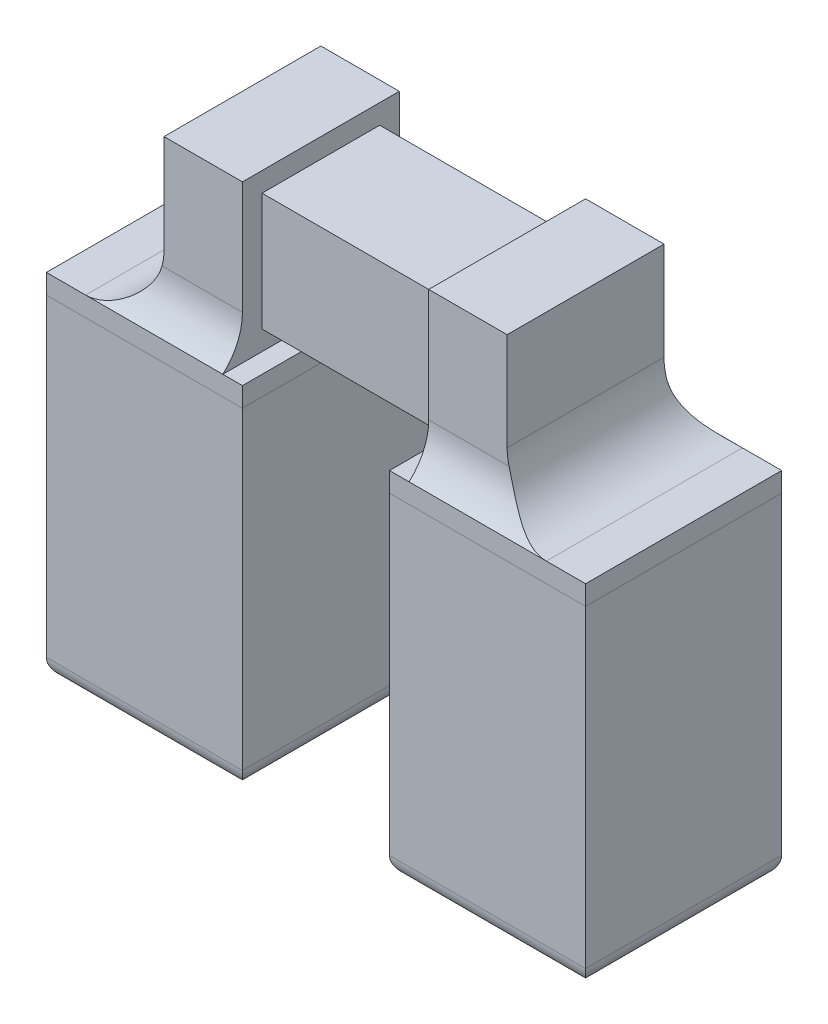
ISO-10303-21;
HEADER;
FILE_DESCRIPTION(('STEP AP214'),'2;1');
FILE_NAME('part.step','',(''),(''),'','','');
FILE_SCHEMA(('AUTOMOTIVE_DESIGN { 1 0 10303 214 1 1 1 1 }'));
ENDSEC;
DATA;
#1=APPLICATION_CONTEXT('core data for automotive mechanical design processes');
#2=APPLICATION_PROTOCOL_DEFINITION('international standard','automotive_design',2000,#1);
#3=PRODUCT_CONTEXT('',#1,'mechanical');
#4=PRODUCT('Part','Part','',(#3));
#5=PRODUCT_RELATED_PRODUCT_CATEGORY('part','',(#4));
#6=PRODUCT_DEFINITION_FORMATION('','',#4);
#7=PRODUCT_DEFINITION_CONTEXT('part definition',#1,'design');
#8=PRODUCT_DEFINITION('design','',#6,#7);
#9=PRODUCT_DEFINITION_SHAPE('','',#8);
#10=(LENGTH_UNIT() NAMED_UNIT(*) SI_UNIT(.MILLI.,.METRE.));
#11=(NAMED_UNIT(*) PLANE_ANGLE_UNIT() SI_UNIT($,.RADIAN.));
#12=(NAMED_UNIT(*) SI_UNIT($,.STERADIAN.) SOLID_ANGLE_UNIT());
#13=UNCERTAINTY_MEASURE_WITH_UNIT(LENGTH_MEASURE(1.E-05),#10,'distance_accuracy_value','');
#14=(GEOMETRIC_REPRESENTATION_CONTEXT(3) GLOBAL_UNCERTAINTY_ASSIGNED_CONTEXT((#13)) GLOBAL_UNIT_ASSIGNED_CONTEXT((#10,
#11,#12)) REPRESENTATION_CONTEXT('',''));
#15=CARTESIAN_POINT('',(0.,0.,0.));
#16=DIRECTION('',(0.,0.,1.));
#17=DIRECTION('',(1.,0.,0.));
#18=AXIS2_PLACEMENT_3D('',#15,#16,#17);
#19=CARTESIAN_POINT('',(0.375,-1.7,0.5));
#20=DIRECTION('',(1.,0.,0.));
#21=DIRECTION('',(0.,0.,-1.));
#22=AXIS2_PLACEMENT_3D('',#19,#20,#21);
#23=PLANE('',#22);
#24=DIRECTION('',(0.,1.,0.));
#25=VECTOR('',#24,1.);
#26=CARTESIAN_POINT('',(0.375,-1.7,-0.5));
#27=LINE('',#26,#25);
#28=CARTESIAN_POINT('',(0.375,-1.6,-0.5));
#29=VERTEX_POINT('',#28);
#30=CARTESIAN_POINT('',(0.375,0.,-0.5));
#31=VERTEX_POINT('',#30);
#32=EDGE_CURVE('E95',#29,#31,#27,.T.);
#33=ORIENTED_EDGE('',*,*,#32,.F.);
#34=DIRECTION('',(0.,0.,-1.));
#35=VECTOR('',#34,1.);
#36=CARTESIAN_POINT('',(0.375,-1.6,0.5));
#37=LINE('',#36,#35);
#38=CARTESIAN_POINT('',(0.375,-1.6,0.5));
#39=VERTEX_POINT('',#38);
#40=EDGE_CURVE('E52',#29,#39,#37,.F.);
#41=ORIENTED_EDGE('',*,*,#40,.T.);
#42=DIRECTION('',(0.,1.,0.));
#43=VECTOR('',#42,1.);
#44=CARTESIAN_POINT('',(0.375,-1.7,0.5));
#45=LINE('',#44,#43);
#46=CARTESIAN_POINT('',(0.375,0.,0.5));
#47=VERTEX_POINT('',#46);
#48=EDGE_CURVE('E112',#39,#47,#45,.T.);
#49=ORIENTED_EDGE('',*,*,#48,.T.);
#50=DIRECTION('',(0.,0.,-1.));
#51=VECTOR('',#50,1.);
#52=CARTESIAN_POINT('',(0.375,0.,0.5));
#53=LINE('',#52,#51);
#54=EDGE_CURVE('E108',#47,#31,#53,.T.);
#55=ORIENTED_EDGE('',*,*,#54,.T.);
#56=EDGE_LOOP('',(#33,#41,#49,#55));
#57=FACE_BOUND('',#56,.T.);
#58=ADVANCED_FACE('F43',(#57),#23,.F.);
#59=CARTESIAN_POINT('',(0.375,-1.7,-0.5));
#60=DIRECTION('',(0.,0.,1.));
#61=DIRECTION('',(1.,0.,0.));
#62=AXIS2_PLACEMENT_3D('',#59,#60,#61);
#63=PLANE('',#62);
#64=DIRECTION('',(0.,1.,0.));
#65=VECTOR('',#64,1.);
#66=CARTESIAN_POINT('',(1.375,-1.7,-0.5));
#67=LINE('',#66,#65);
#68=CARTESIAN_POINT('',(1.375,-1.6,-0.5));
#69=VERTEX_POINT('',#68);
#70=CARTESIAN_POINT('',(1.375,0.,-0.5));
#71=VERTEX_POINT('',#70);
#72=EDGE_CURVE('E102',#69,#71,#67,.T.);
#73=ORIENTED_EDGE('',*,*,#72,.F.);
#74=DIRECTION('',(1.,0.,0.));
#75=VECTOR('',#74,1.);
#76=CARTESIAN_POINT('',(0.375,-1.6,-0.5));
#77=LINE('',#76,#75);
#78=EDGE_CURVE('E67',#69,#29,#77,.F.);
#79=ORIENTED_EDGE('',*,*,#78,.T.);
#80=ORIENTED_EDGE('',*,*,#32,.T.);
#81=DIRECTION('',(1.,0.,0.));
#82=VECTOR('',#81,1.);
#83=CARTESIAN_POINT('',(0.375,0.,-0.5));
#84=LINE('',#83,#82);
#85=EDGE_CURVE('E98',#31,#71,#84,.T.);
#86=ORIENTED_EDGE('',*,*,#85,.T.);
#87=EDGE_LOOP('',(#73,#79,#80,#86));
#88=FACE_BOUND('',#87,.T.);
#89=ADVANCED_FACE('F97',(#88),#63,.F.);
#90=CARTESIAN_POINT('',(1.375,-1.7,0.5));
#91=DIRECTION('',(-1.,0.,0.));
#92=DIRECTION('',(0.,0.,1.));
#93=AXIS2_PLACEMENT_3D('',#90,#91,#92);
#94=PLANE('',#93);
#95=DIRECTION('',(0.,1.,0.));
#96=VECTOR('',#95,1.);
#97=CARTESIAN_POINT('',(1.375,-1.7,0.5));
#98=LINE('',#97,#96);
#99=CARTESIAN_POINT('',(1.375,-1.6,0.5));
#100=VERTEX_POINT('',#99);
#101=CARTESIAN_POINT('',(1.375,0.,0.5));
#102=VERTEX_POINT('',#101);
#103=EDGE_CURVE('E122',#100,#102,#98,.T.);
#104=ORIENTED_EDGE('',*,*,#103,.F.);
#105=DIRECTION('',(0.,0.,1.));
#106=VECTOR('',#105,1.);
#107=CARTESIAN_POINT('',(1.375,-1.6,-0.5));
#108=LINE('',#107,#106);
#109=EDGE_CURVE('E133',#100,#69,#108,.F.);
#110=ORIENTED_EDGE('',*,*,#109,.T.);
#111=ORIENTED_EDGE('',*,*,#72,.T.);
#112=DIRECTION('',(0.,0.,1.));
#113=VECTOR('',#112,1.);
#114=CARTESIAN_POINT('',(1.375,0.,0.5));
#115=LINE('',#114,#113);
#116=EDGE_CURVE('E110',#71,#102,#115,.T.);
#117=ORIENTED_EDGE('',*,*,#116,.T.);
#118=EDGE_LOOP('',(#104,#110,#111,#117));
#119=FACE_BOUND('',#118,.T.);
#120=ADVANCED_FACE('F161',(#119),#94,.F.);
#121=CARTESIAN_POINT('',(0.375,-1.7,0.5));
#122=DIRECTION('',(0.,0.,-1.));
#123=DIRECTION('',(-1.,0.,0.));
#124=AXIS2_PLACEMENT_3D('',#121,#122,#123);
#125=PLANE('',#124);
#126=ORIENTED_EDGE('',*,*,#48,.F.);
#127=DIRECTION('',(-1.,0.,0.));
#128=VECTOR('',#127,1.);
#129=CARTESIAN_POINT('',(1.375,-1.6,0.5));
#130=LINE('',#129,#128);
#131=EDGE_CURVE('E12',#39,#100,#130,.F.);
#132=ORIENTED_EDGE('',*,*,#131,.T.);
#133=ORIENTED_EDGE('',*,*,#103,.T.);
#134=DIRECTION('',(-1.,0.,0.));
#135=VECTOR('',#134,1.);
#136=CARTESIAN_POINT('',(0.375,0.,0.5));
#137=LINE('',#136,#135);
#138=EDGE_CURVE('E119',#102,#47,#137,.T.);
#139=ORIENTED_EDGE('',*,*,#138,.T.);
#140=EDGE_LOOP('',(#126,#132,#133,#139));
#141=FACE_BOUND('',#140,.T.);
#142=ADVANCED_FACE('F163',(#141),#125,.F.);
#143=CARTESIAN_POINT('',(0.,-1.7,0.));
#144=DIRECTION('',(0.,-1.,0.));
#145=DIRECTION('',(0.,0.,-1.));
#146=AXIS2_PLACEMENT_3D('',#143,#144,#145);
#147=PLANE('',#146);
#148=DIRECTION('',(1.,0.,0.));
#149=VECTOR('',#148,1.);
#150=CARTESIAN_POINT('',(1.375,-1.7,-0.4));
#151=LINE('',#150,#149);
#152=CARTESIAN_POINT('',(0.475,-1.7,-0.4));
#153=VERTEX_POINT('',#152);
#154=CARTESIAN_POINT('',(1.275,-1.7,-0.4));
#155=VERTEX_POINT('',#154);
#156=EDGE_CURVE('E128',#153,#155,#151,.T.);
#157=ORIENTED_EDGE('',*,*,#156,.T.);
#158=DIRECTION('',(0.,0.,1.));
#159=VECTOR('',#158,1.);
#160=CARTESIAN_POINT('',(1.275,-1.7,0.5));
#161=LINE('',#160,#159);
#162=CARTESIAN_POINT('',(1.275,-1.7,0.4));
#163=VERTEX_POINT('',#162);
#164=EDGE_CURVE('E130',#155,#163,#161,.T.);
#165=ORIENTED_EDGE('',*,*,#164,.T.);
#166=DIRECTION('',(-1.,0.,0.));
#167=VECTOR('',#166,1.);
#168=CARTESIAN_POINT('',(0.375,-1.7,0.4));
#169=LINE('',#168,#167);
#170=CARTESIAN_POINT('',(0.475,-1.7,0.4));
#171=VERTEX_POINT('',#170);
#172=EDGE_CURVE('E101',#163,#171,#169,.T.);
#173=ORIENTED_EDGE('',*,*,#172,.T.);
#174=DIRECTION('',(0.,0.,-1.));
#175=VECTOR('',#174,1.);
#176=CARTESIAN_POINT('',(0.475,-1.7,-0.5));
#177=LINE('',#176,#175);
#178=EDGE_CURVE('E126',#171,#153,#177,.T.);
#179=ORIENTED_EDGE('',*,*,#178,.T.);
#180=EDGE_LOOP('',(#157,#165,#173,#179));
#181=FACE_BOUND('',#180,.T.);
#182=ADVANCED_FACE('F153',(#181),#147,.T.);
#183=CARTESIAN_POINT('',(0.,0.,0.));
#184=DIRECTION('',(0.,-1.,0.));
#185=DIRECTION('',(0.,0.,-1.));
#186=AXIS2_PLACEMENT_3D('',#183,#184,#185);
#187=PLANE('',#186);
#188=ORIENTED_EDGE('',*,*,#54,.F.);
#189=ORIENTED_EDGE('',*,*,#138,.F.);
#190=ORIENTED_EDGE('',*,*,#116,.F.);
#191=ORIENTED_EDGE('',*,*,#85,.F.);
#192=EDGE_LOOP('',(#188,#189,#190,#191));
#193=FACE_BOUND('',#192,.T.);
#194=ADVANCED_FACE('F106',(#193),#187,.F.);
#195=CARTESIAN_POINT('',(0.475,-1.6,0.));
#196=DIRECTION('',(0.,0.,1.));
#197=DIRECTION('',(1.,0.,0.));
#198=AXIS2_PLACEMENT_3D('',#195,#196,#197);
#199=CYLINDRICAL_SURFACE('',#198,0.1);
#200=CARTESIAN_POINT('',(0.475,-1.6,0.4));
#201=DIRECTION('',(0.707106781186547,0.,0.707106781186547));
#202=DIRECTION('',(0.707106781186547,0.,-0.707106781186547));
#203=AXIS2_PLACEMENT_3D('',#200,#201,#202);
#204=ELLIPSE('',#203,0.14142135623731,0.1);
#205=EDGE_CURVE('E116',#39,#171,#204,.T.);
#206=ORIENTED_EDGE('',*,*,#205,.F.);
#207=ORIENTED_EDGE('',*,*,#40,.F.);
#208=CARTESIAN_POINT('',(0.475,-1.6,-0.4));
#209=DIRECTION('',(-0.707106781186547,0.,0.707106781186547));
#210=DIRECTION('',(0.707106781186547,0.,0.707106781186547));
#211=AXIS2_PLACEMENT_3D('',#208,#209,#210);
#212=ELLIPSE('',#211,0.14142135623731,0.1);
#213=EDGE_CURVE('E47',#153,#29,#212,.F.);
#214=ORIENTED_EDGE('',*,*,#213,.F.);
#215=ORIENTED_EDGE('',*,*,#178,.F.);
#216=EDGE_LOOP('',(#206,#207,#214,#215));
#217=FACE_BOUND('',#216,.T.);
#218=ADVANCED_FACE('F45',(#217),#199,.T.);
#219=CARTESIAN_POINT('',(0.,-1.6,-0.4));
#220=DIRECTION('',(-1.,0.,0.));
#221=DIRECTION('',(0.,0.,1.));
#222=AXIS2_PLACEMENT_3D('',#219,#220,#221);
#223=CYLINDRICAL_SURFACE('',#222,0.1);
#224=ORIENTED_EDGE('',*,*,#213,.T.);
#225=ORIENTED_EDGE('',*,*,#78,.F.);
#226=CARTESIAN_POINT('',(1.275,-1.6,-0.4));
#227=DIRECTION('',(-0.707106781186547,0.,-0.707106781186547));
#228=DIRECTION('',(-0.707106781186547,0.,0.707106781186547));
#229=AXIS2_PLACEMENT_3D('',#226,#227,#228);
#230=ELLIPSE('',#229,0.14142135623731,0.1);
#231=EDGE_CURVE('E140',#155,#69,#230,.F.);
#232=ORIENTED_EDGE('',*,*,#231,.F.);
#233=ORIENTED_EDGE('',*,*,#156,.F.);
#234=EDGE_LOOP('',(#224,#225,#232,#233));
#235=FACE_BOUND('',#234,.T.);
#236=ADVANCED_FACE('F183',(#235),#223,.T.);
#237=CARTESIAN_POINT('',(0.,-1.6,0.4));
#238=DIRECTION('',(1.,0.,0.));
#239=DIRECTION('',(0.,0.,-1.));
#240=AXIS2_PLACEMENT_3D('',#237,#238,#239);
#241=CYLINDRICAL_SURFACE('',#240,0.1);
#242=ORIENTED_EDGE('',*,*,#205,.T.);
#243=ORIENTED_EDGE('',*,*,#172,.F.);
#244=CARTESIAN_POINT('',(1.275,-1.6,0.4));
#245=DIRECTION('',(0.707106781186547,0.,-0.707106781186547));
#246=DIRECTION('',(0.707106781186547,0.,0.707106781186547));
#247=AXIS2_PLACEMENT_3D('',#244,#245,#246);
#248=ELLIPSE('',#247,0.14142135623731,0.1);
#249=EDGE_CURVE('E138',#100,#163,#248,.T.);
#250=ORIENTED_EDGE('',*,*,#249,.F.);
#251=ORIENTED_EDGE('',*,*,#131,.F.);
#252=EDGE_LOOP('',(#242,#243,#250,#251));
#253=FACE_BOUND('',#252,.T.);
#254=ADVANCED_FACE('F146',(#253),#241,.T.);
#255=CARTESIAN_POINT('',(1.275,-1.6,0.));
#256=DIRECTION('',(0.,0.,-1.));
#257=DIRECTION('',(-1.,0.,0.));
#258=AXIS2_PLACEMENT_3D('',#255,#256,#257);
#259=CYLINDRICAL_SURFACE('',#258,0.1);
#260=ORIENTED_EDGE('',*,*,#231,.T.);
#261=ORIENTED_EDGE('',*,*,#109,.F.);
#262=ORIENTED_EDGE('',*,*,#249,.T.);
#263=ORIENTED_EDGE('',*,*,#164,.F.);
#264=EDGE_LOOP('',(#260,#261,#262,#263));
#265=FACE_BOUND('',#264,.T.);
#266=ADVANCED_FACE('F157',(#265),#259,.T.);
#267=CLOSED_SHELL('',(#58,#89,#120,#142,#182,#194,#218,#236,#254,#266));
#268=MANIFOLD_SOLID_BREP('B2',#267);
#269=CARTESIAN_POINT('',(-1.375,-1.7,0.5));
#270=DIRECTION('',(1.,0.,0.));
#271=DIRECTION('',(0.,0.,-1.));
#272=AXIS2_PLACEMENT_3D('',#269,#270,#271);
#273=PLANE('',#272);
#274=DIRECTION('',(0.,1.,0.));
#275=VECTOR('',#274,1.);
#276=CARTESIAN_POINT('',(-1.375,-1.7,-0.5));
#277=LINE('',#276,#275);
#278=CARTESIAN_POINT('',(-1.375,-1.6,-0.5));
#279=VERTEX_POINT('',#278);
#280=CARTESIAN_POINT('',(-1.375,0.,-0.5));
#281=VERTEX_POINT('',#280);
#282=EDGE_CURVE('E307',#279,#281,#277,.T.);
#283=ORIENTED_EDGE('',*,*,#282,.F.);
#284=DIRECTION('',(0.,0.,-1.));
#285=VECTOR('',#284,1.);
#286=CARTESIAN_POINT('',(-1.375,-1.6,0.5));
#287=LINE('',#286,#285);
#288=CARTESIAN_POINT('',(-1.375,-1.6,0.5));
#289=VERTEX_POINT('',#288);
#290=EDGE_CURVE('E265',#279,#289,#287,.F.);
#291=ORIENTED_EDGE('',*,*,#290,.T.);
#292=DIRECTION('',(0.,1.,0.));
#293=VECTOR('',#292,1.);
#294=CARTESIAN_POINT('',(-1.375,-1.7,0.5));
#295=LINE('',#294,#293);
#296=CARTESIAN_POINT('',(-1.375,0.,0.5));
#297=VERTEX_POINT('',#296);
#298=EDGE_CURVE('E324',#289,#297,#295,.T.);
#299=ORIENTED_EDGE('',*,*,#298,.T.);
#300=DIRECTION('',(0.,0.,-1.));
#301=VECTOR('',#300,1.);
#302=CARTESIAN_POINT('',(-1.375,0.,0.5));
#303=LINE('',#302,#301);
#304=EDGE_CURVE('E320',#297,#281,#303,.T.);
#305=ORIENTED_EDGE('',*,*,#304,.T.);
#306=EDGE_LOOP('',(#283,#291,#299,#305));
#307=FACE_BOUND('',#306,.T.);
#308=ADVANCED_FACE('F256',(#307),#273,.F.);
#309=CARTESIAN_POINT('',(-1.375,-1.7,-0.5));
#310=DIRECTION('',(0.,0.,1.));
#311=DIRECTION('',(1.,0.,0.));
#312=AXIS2_PLACEMENT_3D('',#309,#310,#311);
#313=PLANE('',#312);
#314=DIRECTION('',(0.,1.,0.));
#315=VECTOR('',#314,1.);
#316=CARTESIAN_POINT('',(-0.375,-1.7,-0.5));
#317=LINE('',#316,#315);
#318=CARTESIAN_POINT('',(-0.375,-1.6,-0.5));
#319=VERTEX_POINT('',#318);
#320=CARTESIAN_POINT('',(-0.375,0.,-0.5));
#321=VERTEX_POINT('',#320);
#322=EDGE_CURVE('E314',#319,#321,#317,.T.);
#323=ORIENTED_EDGE('',*,*,#322,.F.);
#324=DIRECTION('',(1.,0.,0.));
#325=VECTOR('',#324,1.);
#326=CARTESIAN_POINT('',(-1.375,-1.6,-0.5));
#327=LINE('',#326,#325);
#328=EDGE_CURVE('E41',#319,#279,#327,.F.);
#329=ORIENTED_EDGE('',*,*,#328,.T.);
#330=ORIENTED_EDGE('',*,*,#282,.T.);
#331=DIRECTION('',(1.,0.,0.));
#332=VECTOR('',#331,1.);
#333=CARTESIAN_POINT('',(-1.375,0.,-0.5));
#334=LINE('',#333,#332);
#335=EDGE_CURVE('E310',#281,#321,#334,.T.);
#336=ORIENTED_EDGE('',*,*,#335,.T.);
#337=EDGE_LOOP('',(#323,#329,#330,#336));
#338=FACE_BOUND('',#337,.T.);
#339=ADVANCED_FACE('F309',(#338),#313,.F.);
#340=CARTESIAN_POINT('',(-0.375,-1.7,0.5));
#341=DIRECTION('',(-1.,0.,0.));
#342=DIRECTION('',(0.,0.,1.));
#343=AXIS2_PLACEMENT_3D('',#340,#341,#342);
#344=PLANE('',#343);
#345=DIRECTION('',(0.,1.,0.));
#346=VECTOR('',#345,1.);
#347=CARTESIAN_POINT('',(-0.375,-1.7,0.5));
#348=LINE('',#347,#346);
#349=CARTESIAN_POINT('',(-0.375,-1.6,0.5));
#350=VERTEX_POINT('',#349);
#351=CARTESIAN_POINT('',(-0.375,0.,0.5));
#352=VERTEX_POINT('',#351);
#353=EDGE_CURVE('E334',#350,#352,#348,.T.);
#354=ORIENTED_EDGE('',*,*,#353,.F.);
#355=DIRECTION('',(0.,0.,1.));
#356=VECTOR('',#355,1.);
#357=CARTESIAN_POINT('',(-0.375,-1.6,-0.5));
#358=LINE('',#357,#356);
#359=EDGE_CURVE('E345',#350,#319,#358,.F.);
#360=ORIENTED_EDGE('',*,*,#359,.T.);
#361=ORIENTED_EDGE('',*,*,#322,.T.);
#362=DIRECTION('',(0.,0.,1.));
#363=VECTOR('',#362,1.);
#364=CARTESIAN_POINT('',(-0.375,0.,0.5));
#365=LINE('',#364,#363);
#366=EDGE_CURVE('E322',#321,#352,#365,.T.);
#367=ORIENTED_EDGE('',*,*,#366,.T.);
#368=EDGE_LOOP('',(#354,#360,#361,#367));
#369=FACE_BOUND('',#368,.T.);
#370=ADVANCED_FACE('F374',(#369),#344,.F.);
#371=CARTESIAN_POINT('',(-1.375,-1.7,0.5));
#372=DIRECTION('',(0.,0.,-1.));
#373=DIRECTION('',(-1.,0.,0.));
#374=AXIS2_PLACEMENT_3D('',#371,#372,#373);
#375=PLANE('',#374);
#376=ORIENTED_EDGE('',*,*,#298,.F.);
#377=DIRECTION('',(-1.,0.,0.));
#378=VECTOR('',#377,1.);
#379=CARTESIAN_POINT('',(-0.375,-1.6,0.5));
#380=LINE('',#379,#378);
#381=EDGE_CURVE('E348',#289,#350,#380,.F.);
#382=ORIENTED_EDGE('',*,*,#381,.T.);
#383=ORIENTED_EDGE('',*,*,#353,.T.);
#384=DIRECTION('',(-1.,0.,0.));
#385=VECTOR('',#384,1.);
#386=CARTESIAN_POINT('',(-1.375,0.,0.5));
#387=LINE('',#386,#385);
#388=EDGE_CURVE('E331',#352,#297,#387,.T.);
#389=ORIENTED_EDGE('',*,*,#388,.T.);
#390=EDGE_LOOP('',(#376,#382,#383,#389));
#391=FACE_BOUND('',#390,.T.);
#392=ADVANCED_FACE('F376',(#391),#375,.F.);
#393=CARTESIAN_POINT('',(0.,-1.7,0.));
#394=DIRECTION('',(0.,-1.,0.));
#395=DIRECTION('',(0.,0.,-1.));
#396=AXIS2_PLACEMENT_3D('',#393,#394,#395);
#397=PLANE('',#396);
#398=DIRECTION('',(1.,0.,0.));
#399=VECTOR('',#398,1.);
#400=CARTESIAN_POINT('',(-0.375,-1.7,-0.4));
#401=LINE('',#400,#399);
#402=CARTESIAN_POINT('',(-1.275,-1.7,-0.4));
#403=VERTEX_POINT('',#402);
#404=CARTESIAN_POINT('',(-0.475,-1.7,-0.4));
#405=VERTEX_POINT('',#404);
#406=EDGE_CURVE('E313',#403,#405,#401,.T.);
#407=ORIENTED_EDGE('',*,*,#406,.T.);
#408=DIRECTION('',(0.,0.,1.));
#409=VECTOR('',#408,1.);
#410=CARTESIAN_POINT('',(-0.475,-1.7,0.5));
#411=LINE('',#410,#409);
#412=CARTESIAN_POINT('',(-0.475,-1.7,0.4));
#413=VERTEX_POINT('',#412);
#414=EDGE_CURVE('E342',#405,#413,#411,.T.);
#415=ORIENTED_EDGE('',*,*,#414,.T.);
#416=DIRECTION('',(-1.,0.,0.));
#417=VECTOR('',#416,1.);
#418=CARTESIAN_POINT('',(-1.375,-1.7,0.4));
#419=LINE('',#418,#417);
#420=CARTESIAN_POINT('',(-1.275,-1.7,0.4));
#421=VERTEX_POINT('',#420);
#422=EDGE_CURVE('E340',#413,#421,#419,.T.);
#423=ORIENTED_EDGE('',*,*,#422,.T.);
#424=DIRECTION('',(0.,0.,-1.));
#425=VECTOR('',#424,1.);
#426=CARTESIAN_POINT('',(-1.275,-1.7,-0.5));
#427=LINE('',#426,#425);
#428=EDGE_CURVE('E338',#421,#403,#427,.T.);
#429=ORIENTED_EDGE('',*,*,#428,.T.);
#430=EDGE_LOOP('',(#407,#415,#423,#429));
#431=FACE_BOUND('',#430,.T.);
#432=ADVANCED_FACE('F366',(#431),#397,.T.);
#433=CARTESIAN_POINT('',(0.,0.,0.));
#434=DIRECTION('',(0.,-1.,0.));
#435=DIRECTION('',(0.,0.,-1.));
#436=AXIS2_PLACEMENT_3D('',#433,#434,#435);
#437=PLANE('',#436);
#438=ORIENTED_EDGE('',*,*,#304,.F.);
#439=ORIENTED_EDGE('',*,*,#388,.F.);
#440=ORIENTED_EDGE('',*,*,#366,.F.);
#441=ORIENTED_EDGE('',*,*,#335,.F.);
#442=EDGE_LOOP('',(#438,#439,#440,#441));
#443=FACE_BOUND('',#442,.T.);
#444=ADVANCED_FACE('F318',(#443),#437,.F.);
#445=CARTESIAN_POINT('',(-1.275,-1.6,0.));
#446=DIRECTION('',(0.,0.,1.));
#447=DIRECTION('',(1.,0.,0.));
#448=AXIS2_PLACEMENT_3D('',#445,#446,#447);
#449=CYLINDRICAL_SURFACE('',#448,0.1);
#450=CARTESIAN_POINT('',(-1.275,-1.6,0.4));
#451=DIRECTION('',(0.707106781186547,0.,0.707106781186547));
#452=DIRECTION('',(-0.707106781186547,0.,0.707106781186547));
#453=AXIS2_PLACEMENT_3D('',#450,#451,#452);
#454=ELLIPSE('',#453,0.14142135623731,0.1);
#455=EDGE_CURVE('E328',#289,#421,#454,.T.);
#456=ORIENTED_EDGE('',*,*,#455,.F.);
#457=ORIENTED_EDGE('',*,*,#290,.F.);
#458=CARTESIAN_POINT('',(-1.275,-1.6,-0.4));
#459=DIRECTION('',(-0.707106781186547,0.,0.707106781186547));
#460=DIRECTION('',(-0.707106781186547,0.,-0.707106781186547));
#461=AXIS2_PLACEMENT_3D('',#458,#459,#460);
#462=ELLIPSE('',#461,0.14142135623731,0.1);
#463=EDGE_CURVE('E260',#403,#279,#462,.F.);
#464=ORIENTED_EDGE('',*,*,#463,.F.);
#465=ORIENTED_EDGE('',*,*,#428,.F.);
#466=EDGE_LOOP('',(#456,#457,#464,#465));
#467=FACE_BOUND('',#466,.T.);
#468=ADVANCED_FACE('F258',(#467),#449,.T.);
#469=CARTESIAN_POINT('',(0.,-1.6,-0.4));
#470=DIRECTION('',(-1.,0.,0.));
#471=DIRECTION('',(0.,0.,1.));
#472=AXIS2_PLACEMENT_3D('',#469,#470,#471);
#473=CYLINDRICAL_SURFACE('',#472,0.1);
#474=ORIENTED_EDGE('',*,*,#463,.T.);
#475=ORIENTED_EDGE('',*,*,#328,.F.);
#476=CARTESIAN_POINT('',(-0.475,-1.6,-0.4));
#477=DIRECTION('',(-0.707106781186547,0.,-0.707106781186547));
#478=DIRECTION('',(-0.707106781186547,0.,0.707106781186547));
#479=AXIS2_PLACEMENT_3D('',#476,#477,#478);
#480=ELLIPSE('',#479,0.14142135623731,0.1);
#481=EDGE_CURVE('E353',#405,#319,#480,.F.);
#482=ORIENTED_EDGE('',*,*,#481,.F.);
#483=ORIENTED_EDGE('',*,*,#406,.F.);
#484=EDGE_LOOP('',(#474,#475,#482,#483));
#485=FACE_BOUND('',#484,.T.);
#486=ADVANCED_FACE('F396',(#485),#473,.T.);
#487=CARTESIAN_POINT('',(0.,-1.6,0.4));
#488=DIRECTION('',(1.,0.,0.));
#489=DIRECTION('',(0.,0.,-1.));
#490=AXIS2_PLACEMENT_3D('',#487,#488,#489);
#491=CYLINDRICAL_SURFACE('',#490,0.1);
#492=ORIENTED_EDGE('',*,*,#455,.T.);
#493=ORIENTED_EDGE('',*,*,#422,.F.);
#494=CARTESIAN_POINT('',(-0.475,-1.6,0.4));
#495=DIRECTION('',(0.707106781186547,0.,-0.707106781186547));
#496=DIRECTION('',(0.707106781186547,0.,0.707106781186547));
#497=AXIS2_PLACEMENT_3D('',#494,#495,#496);
#498=ELLIPSE('',#497,0.14142135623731,0.1);
#499=EDGE_CURVE('E351',#350,#413,#498,.T.);
#500=ORIENTED_EDGE('',*,*,#499,.F.);
#501=ORIENTED_EDGE('',*,*,#381,.F.);
#502=EDGE_LOOP('',(#492,#493,#500,#501));
#503=FACE_BOUND('',#502,.T.);
#504=ADVANCED_FACE('F359',(#503),#491,.T.);
#505=CARTESIAN_POINT('',(-0.475,-1.6,0.));
#506=DIRECTION('',(0.,0.,-1.));
#507=DIRECTION('',(-1.,0.,0.));
#508=AXIS2_PLACEMENT_3D('',#505,#506,#507);
#509=CYLINDRICAL_SURFACE('',#508,0.1);
#510=ORIENTED_EDGE('',*,*,#481,.T.);
#511=ORIENTED_EDGE('',*,*,#359,.F.);
#512=ORIENTED_EDGE('',*,*,#499,.T.);
#513=ORIENTED_EDGE('',*,*,#414,.F.);
#514=EDGE_LOOP('',(#510,#511,#512,#513));
#515=FACE_BOUND('',#514,.T.);
#516=ADVANCED_FACE('F370',(#515),#509,.T.);
#517=CLOSED_SHELL('',(#308,#339,#370,#392,#432,#444,#468,#486,#504,#516));
#518=MANIFOLD_SOLID_BREP('B6',#517);
#519=CARTESIAN_POINT('',(0.475,0.9,-0.4));
#520=DIRECTION('',(1.,0.,0.));
#521=DIRECTION('',(0.,0.,-1.));
#522=AXIS2_PLACEMENT_3D('',#519,#520,#521);
#523=PLANE('',#522);
#524=DIRECTION('',(0.,-1.,0.));
#525=VECTOR('',#524,1.);
#526=CARTESIAN_POINT('',(0.474999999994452,0.8,0.3));
#527=LINE('',#526,#525);
#528=CARTESIAN_POINT('',(0.474999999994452,0.8,0.3));
#529=VERTEX_POINT('',#528);
#530=CARTESIAN_POINT('',(0.474999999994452,0.2,0.3));
#531=VERTEX_POINT('',#530);
#532=EDGE_CURVE('E514',#529,#531,#527,.T.);
#533=ORIENTED_EDGE('',*,*,#532,.T.);
#534=DIRECTION('',(0.,0.,-1.));
#535=VECTOR('',#534,1.);
#536=CARTESIAN_POINT('',(0.474999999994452,0.2,0.300000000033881));
#537=LINE('',#536,#535);
#538=CARTESIAN_POINT('',(0.474999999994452,0.2,-0.3));
#539=VERTEX_POINT('',#538);
#540=EDGE_CURVE('E519',#531,#539,#537,.T.);
#541=ORIENTED_EDGE('',*,*,#540,.T.);
#542=DIRECTION('',(0.,1.,0.));
#543=VECTOR('',#542,1.);
#544=CARTESIAN_POINT('',(0.474999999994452,0.8,-0.3));
#545=LINE('',#544,#543);
#546=CARTESIAN_POINT('',(0.474999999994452,0.8,-0.3));
#547=VERTEX_POINT('',#546);
#548=EDGE_CURVE('E516',#539,#547,#545,.T.);
#549=ORIENTED_EDGE('',*,*,#548,.T.);
#550=DIRECTION('',(0.,0.,1.));
#551=VECTOR('',#550,1.);
#552=CARTESIAN_POINT('',(0.474999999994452,0.8,0.300000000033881));
#553=LINE('',#552,#551);
#554=EDGE_CURVE('E473',#547,#529,#553,.T.);
#555=ORIENTED_EDGE('',*,*,#554,.T.);
#556=EDGE_LOOP('',(#533,#541,#549,#555));
#557=FACE_BOUND('',#556,.T.);
#558=ADVANCED_FACE('F469',(#557),#523,.T.);
#559=CARTESIAN_POINT('',(500000.,0.8,0.3));
#560=DIRECTION('',(0.,0.,-1.));
#561=DIRECTION('',(0.,1.,0.));
#562=AXIS2_PLACEMENT_3D('',#559,#560,#561);
#563=PLANE('',#562);
#564=ORIENTED_EDGE('',*,*,#532,.F.);
#565=DIRECTION('',(-1.,0.,0.));
#566=VECTOR('',#565,1.);
#567=CARTESIAN_POINT('',(500000.,0.8,0.3));
#568=LINE('',#567,#566);
#569=CARTESIAN_POINT('',(-0.475,0.8,0.3));
#570=VERTEX_POINT('',#569);
#571=EDGE_CURVE('E485',#529,#570,#568,.T.);
#572=ORIENTED_EDGE('',*,*,#571,.T.);
#573=DIRECTION('',(0.,-1.,0.));
#574=VECTOR('',#573,1.);
#575=CARTESIAN_POINT('',(-0.475,0.8,0.3));
#576=LINE('',#575,#574);
#577=CARTESIAN_POINT('',(-0.475,0.2,0.3));
#578=VERTEX_POINT('',#577);
#579=EDGE_CURVE('E254',#570,#578,#576,.T.);
#580=ORIENTED_EDGE('',*,*,#579,.T.);
#581=DIRECTION('',(-1.,0.,0.));
#582=VECTOR('',#581,1.);
#583=CARTESIAN_POINT('',(500000.,0.2,0.3));
#584=LINE('',#583,#582);
#585=EDGE_CURVE('E518',#531,#578,#584,.T.);
#586=ORIENTED_EDGE('',*,*,#585,.F.);
#587=EDGE_LOOP('',(#564,#572,#580,#586));
#588=FACE_BOUND('',#587,.T.);
#589=ADVANCED_FACE('F517',(#588),#563,.F.);
#590=CARTESIAN_POINT('',(500000.,0.2,0.3));
#591=DIRECTION('',(0.,1.,0.));
#592=DIRECTION('',(0.,0.,1.));
#593=AXIS2_PLACEMENT_3D('',#590,#591,#592);
#594=PLANE('',#593);
#595=ORIENTED_EDGE('',*,*,#540,.F.);
#596=ORIENTED_EDGE('',*,*,#585,.T.);
#597=DIRECTION('',(0.,0.,-1.));
#598=VECTOR('',#597,1.);
#599=CARTESIAN_POINT('',(-0.475,0.2,0.3));
#600=LINE('',#599,#598);
#601=CARTESIAN_POINT('',(-0.475,0.2,-0.3));
#602=VERTEX_POINT('',#601);
#603=EDGE_CURVE('E478',#578,#602,#600,.T.);
#604=ORIENTED_EDGE('',*,*,#603,.T.);
#605=DIRECTION('',(-1.,0.,0.));
#606=VECTOR('',#605,1.);
#607=CARTESIAN_POINT('',(500000.,0.2,-0.3));
#608=LINE('',#607,#606);
#609=EDGE_CURVE('E527',#539,#602,#608,.T.);
#610=ORIENTED_EDGE('',*,*,#609,.F.);
#611=EDGE_LOOP('',(#595,#596,#604,#610));
#612=FACE_BOUND('',#611,.T.);
#613=ADVANCED_FACE('F534',(#612),#594,.F.);
#614=CARTESIAN_POINT('',(500000.,0.8,-0.3));
#615=DIRECTION('',(0.,0.,1.));
#616=DIRECTION('',(0.,-1.,0.));
#617=AXIS2_PLACEMENT_3D('',#614,#615,#616);
#618=PLANE('',#617);
#619=ORIENTED_EDGE('',*,*,#548,.F.);
#620=ORIENTED_EDGE('',*,*,#609,.T.);
#621=DIRECTION('',(0.,1.,0.));
#622=VECTOR('',#621,1.);
#623=CARTESIAN_POINT('',(-0.475,0.8,-0.3));
#624=LINE('',#623,#622);
#625=CARTESIAN_POINT('',(-0.475,0.8,-0.3));
#626=VERTEX_POINT('',#625);
#627=EDGE_CURVE('E525',#602,#626,#624,.T.);
#628=ORIENTED_EDGE('',*,*,#627,.T.);
#629=DIRECTION('',(-1.,0.,0.));
#630=VECTOR('',#629,1.);
#631=CARTESIAN_POINT('',(500000.,0.8,-0.3));
#632=LINE('',#631,#630);
#633=EDGE_CURVE('E492',#547,#626,#632,.T.);
#634=ORIENTED_EDGE('',*,*,#633,.F.);
#635=EDGE_LOOP('',(#619,#620,#628,#634));
#636=FACE_BOUND('',#635,.T.);
#637=ADVANCED_FACE('F541',(#636),#618,.F.);
#638=CARTESIAN_POINT('',(500000.,0.8,0.3));
#639=DIRECTION('',(0.,-1.,0.));
#640=DIRECTION('',(0.,0.,-1.));
#641=AXIS2_PLACEMENT_3D('',#638,#639,#640);
#642=PLANE('',#641);
#643=ORIENTED_EDGE('',*,*,#554,.F.);
#644=ORIENTED_EDGE('',*,*,#633,.T.);
#645=DIRECTION('',(0.,0.,1.));
#646=VECTOR('',#645,1.);
#647=CARTESIAN_POINT('',(-0.475,0.8,0.3));
#648=LINE('',#647,#646);
#649=EDGE_CURVE('E522',#626,#570,#648,.T.);
#650=ORIENTED_EDGE('',*,*,#649,.T.);
#651=ORIENTED_EDGE('',*,*,#571,.F.);
#652=EDGE_LOOP('',(#643,#644,#650,#651));
#653=FACE_BOUND('',#652,.T.);
#654=ADVANCED_FACE('F471',(#653),#642,.F.);
#655=CARTESIAN_POINT('',(-0.475,0.,0.));
#656=DIRECTION('',(1.,0.,0.));
#657=DIRECTION('',(0.,0.,-1.));
#658=AXIS2_PLACEMENT_3D('',#655,#656,#657);
#659=PLANE('',#658);
#660=ORIENTED_EDGE('',*,*,#579,.F.);
#661=ORIENTED_EDGE('',*,*,#649,.F.);
#662=ORIENTED_EDGE('',*,*,#627,.F.);
#663=ORIENTED_EDGE('',*,*,#603,.F.);
#664=EDGE_LOOP('',(#660,#661,#662,#663));
#665=FACE_BOUND('',#664,.T.);
#666=ADVANCED_FACE('F543',(#665),#659,.F.);
#667=CLOSED_SHELL('',(#558,#589,#613,#637,#654,#666));
#668=MANIFOLD_SOLID_BREP('B35',#667);
#669=CARTESIAN_POINT('',(0.,0.1,0.));
#670=DIRECTION('',(0.,1.,0.));
#671=DIRECTION('',(0.,0.,1.));
#672=AXIS2_PLACEMENT_3D('',#669,#670,#671);
#673=PLANE('',#672);
#674=DIRECTION('',(0.,0.,1.));
#675=VECTOR('',#674,1.);
#676=CARTESIAN_POINT('',(0.475,0.1,-0.4));
#677=LINE('',#676,#675);
#678=CARTESIAN_POINT('',(0.475,0.1,-0.5));
#679=VERTEX_POINT('',#678);
#680=CARTESIAN_POINT('',(0.475,0.1,0.5));
#681=VERTEX_POINT('',#680);
#682=EDGE_CURVE('E710',#679,#681,#677,.T.);
#683=ORIENTED_EDGE('',*,*,#682,.F.);
#684=DIRECTION('',(-1.,0.,0.));
#685=VECTOR('',#684,1.);
#686=CARTESIAN_POINT('',(0.375,0.1,-0.5));
#687=LINE('',#686,#685);
#688=CARTESIAN_POINT('',(0.375,0.1,-0.5));
#689=VERTEX_POINT('',#688);
#690=EDGE_CURVE('E734',#679,#689,#687,.T.);
#691=ORIENTED_EDGE('',*,*,#690,.T.);
#692=DIRECTION('',(0.,0.,1.));
#693=VECTOR('',#692,1.);
#694=CARTESIAN_POINT('',(0.375,0.1,-0.5));
#695=LINE('',#694,#693);
#696=CARTESIAN_POINT('',(0.375,0.1,0.5));
#697=VERTEX_POINT('',#696);
#698=EDGE_CURVE('E723',#689,#697,#695,.T.);
#699=ORIENTED_EDGE('',*,*,#698,.T.);
#700=DIRECTION('',(1.,0.,0.));
#701=VECTOR('',#700,1.);
#702=CARTESIAN_POINT('',(0.375,0.1,0.5));
#703=LINE('',#702,#701);
#704=EDGE_CURVE('E728',#697,#681,#703,.T.);
#705=ORIENTED_EDGE('',*,*,#704,.T.);
#706=EDGE_LOOP('',(#683,#691,#699,#705));
#707=FACE_BOUND('',#706,.T.);
#708=ADVANCED_FACE('F601',(#707),#673,.T.);
#709=CARTESIAN_POINT('',(1.375,0.1,-0.5));
#710=VERTEX_POINT('',#709);
#711=CARTESIAN_POINT('',(1.175,0.1,-0.5));
#712=VERTEX_POINT('',#711);
#713=EDGE_CURVE('E735',#710,#712,#687,.T.);
#714=ORIENTED_EDGE('',*,*,#713,.T.);
#715=DIRECTION('',(0.,0.,-1.));
#716=VECTOR('',#715,1.);
#717=CARTESIAN_POINT('',(1.175,0.1,0.));
#718=LINE('',#717,#716);
#719=CARTESIAN_POINT('',(1.175,0.1,0.5));
#720=VERTEX_POINT('',#719);
#721=EDGE_CURVE('E756',#712,#720,#718,.F.);
#722=ORIENTED_EDGE('',*,*,#721,.T.);
#723=CARTESIAN_POINT('',(1.375,0.1,0.5));
#724=VERTEX_POINT('',#723);
#725=EDGE_CURVE('E726',#720,#724,#703,.T.);
#726=ORIENTED_EDGE('',*,*,#725,.T.);
#727=DIRECTION('',(0.,0.,-1.));
#728=VECTOR('',#727,1.);
#729=CARTESIAN_POINT('',(1.375,0.1,-0.5));
#730=LINE('',#729,#728);
#731=EDGE_CURVE('E731',#724,#710,#730,.T.);
#732=ORIENTED_EDGE('',*,*,#731,.T.);
#733=EDGE_LOOP('',(#714,#722,#726,#732));
#734=FACE_BOUND('',#733,.T.);
#735=ADVANCED_FACE('F782',(#734),#673,.T.);
#736=CARTESIAN_POINT('',(0.375,0.1,-0.5));
#737=DIRECTION('',(1.,0.,0.));
#738=DIRECTION('',(0.,0.,-1.));
#739=AXIS2_PLACEMENT_3D('',#736,#737,#738);
#740=PLANE('',#739);
#741=DIRECTION('',(0.,0.,1.));
#742=VECTOR('',#741,1.);
#743=CARTESIAN_POINT('',(0.375,0.,-0.5));
#744=LINE('',#743,#742);
#745=CARTESIAN_POINT('',(0.375,0.,-0.5));
#746=VERTEX_POINT('',#745);
#747=CARTESIAN_POINT('',(0.375,0.,0.5));
#748=VERTEX_POINT('',#747);
#749=EDGE_CURVE('E714',#746,#748,#744,.T.);
#750=ORIENTED_EDGE('',*,*,#749,.T.);
#751=DIRECTION('',(0.,-1.,0.));
#752=VECTOR('',#751,1.);
#753=CARTESIAN_POINT('',(0.375,0.1,0.5));
#754=LINE('',#753,#752);
#755=EDGE_CURVE('E752',#697,#748,#754,.T.);
#756=ORIENTED_EDGE('',*,*,#755,.F.);
#757=ORIENTED_EDGE('',*,*,#698,.F.);
#758=DIRECTION('',(0.,-1.,0.));
#759=VECTOR('',#758,1.);
#760=CARTESIAN_POINT('',(0.375,0.1,-0.5));
#761=LINE('',#760,#759);
#762=EDGE_CURVE('E737',#689,#746,#761,.T.);
#763=ORIENTED_EDGE('',*,*,#762,.T.);
#764=EDGE_LOOP('',(#750,#756,#757,#763));
#765=FACE_BOUND('',#764,.T.);
#766=ADVANCED_FACE('F788',(#765),#740,.F.);
#767=CARTESIAN_POINT('',(0.375,0.1,0.5));
#768=DIRECTION('',(0.,0.,-1.));
#769=DIRECTION('',(-1.,0.,0.));
#770=AXIS2_PLACEMENT_3D('',#767,#768,#769);
#771=PLANE('',#770);
#772=DIRECTION('',(1.,0.,0.));
#773=VECTOR('',#772,1.);
#774=CARTESIAN_POINT('',(0.375,0.,0.5));
#775=LINE('',#774,#773);
#776=CARTESIAN_POINT('',(1.375,0.,0.5));
#777=VERTEX_POINT('',#776);
#778=EDGE_CURVE('E717',#748,#777,#775,.T.);
#779=ORIENTED_EDGE('',*,*,#778,.T.);
#780=DIRECTION('',(0.,-1.,0.));
#781=VECTOR('',#780,1.);
#782=CARTESIAN_POINT('',(1.375,0.1,0.5));
#783=LINE('',#782,#781);
#784=EDGE_CURVE('E749',#724,#777,#783,.T.);
#785=ORIENTED_EDGE('',*,*,#784,.F.);
#786=ORIENTED_EDGE('',*,*,#725,.F.);
#787=EDGE_CURVE('E732',#681,#720,#703,.T.);
#788=ORIENTED_EDGE('',*,*,#787,.F.);
#789=ORIENTED_EDGE('',*,*,#704,.F.);
#790=ORIENTED_EDGE('',*,*,#755,.T.);
#791=EDGE_LOOP('',(#779,#785,#786,#788,#789,#790));
#792=FACE_BOUND('',#791,.T.);
#793=ADVANCED_FACE('F804',(#792),#771,.F.);
#794=CARTESIAN_POINT('',(1.375,0.1,-0.5));
#795=DIRECTION('',(-1.,0.,0.));
#796=DIRECTION('',(0.,0.,1.));
#797=AXIS2_PLACEMENT_3D('',#794,#795,#796);
#798=PLANE('',#797);
#799=DIRECTION('',(0.,0.,-1.));
#800=VECTOR('',#799,1.);
#801=CARTESIAN_POINT('',(1.375,0.,-0.5));
#802=LINE('',#801,#800);
#803=CARTESIAN_POINT('',(1.375,0.,-0.5));
#804=VERTEX_POINT('',#803);
#805=EDGE_CURVE('E741',#777,#804,#802,.T.);
#806=ORIENTED_EDGE('',*,*,#805,.T.);
#807=DIRECTION('',(0.,-1.,0.));
#808=VECTOR('',#807,1.);
#809=CARTESIAN_POINT('',(1.375,0.1,-0.5));
#810=LINE('',#809,#808);
#811=EDGE_CURVE('E746',#710,#804,#810,.T.);
#812=ORIENTED_EDGE('',*,*,#811,.F.);
#813=ORIENTED_EDGE('',*,*,#731,.F.);
#814=ORIENTED_EDGE('',*,*,#784,.T.);
#815=EDGE_LOOP('',(#806,#812,#813,#814));
#816=FACE_BOUND('',#815,.T.);
#817=ADVANCED_FACE('F800',(#816),#798,.F.);
#818=CARTESIAN_POINT('',(0.375,0.1,-0.5));
#819=DIRECTION('',(0.,0.,1.));
#820=DIRECTION('',(1.,0.,0.));
#821=AXIS2_PLACEMENT_3D('',#818,#819,#820);
#822=PLANE('',#821);
#823=DIRECTION('',(-1.,0.,0.));
#824=VECTOR('',#823,1.);
#825=CARTESIAN_POINT('',(0.375,0.,-0.5));
#826=LINE('',#825,#824);
#827=EDGE_CURVE('E727',#804,#746,#826,.T.);
#828=ORIENTED_EDGE('',*,*,#827,.T.);
#829=ORIENTED_EDGE('',*,*,#762,.F.);
#830=ORIENTED_EDGE('',*,*,#690,.F.);
#831=EDGE_CURVE('E738',#712,#679,#687,.T.);
#832=ORIENTED_EDGE('',*,*,#831,.F.);
#833=ORIENTED_EDGE('',*,*,#713,.F.);
#834=ORIENTED_EDGE('',*,*,#811,.T.);
#835=EDGE_LOOP('',(#828,#829,#830,#832,#833,#834));
#836=FACE_BOUND('',#835,.T.);
#837=ADVANCED_FACE('F796',(#836),#822,.F.);
#838=CARTESIAN_POINT('',(0.,0.,0.));
#839=DIRECTION('',(0.,1.,0.));
#840=DIRECTION('',(0.,0.,1.));
#841=AXIS2_PLACEMENT_3D('',#838,#839,#840);
#842=PLANE('',#841);
#843=ORIENTED_EDGE('',*,*,#749,.F.);
#844=ORIENTED_EDGE('',*,*,#827,.F.);
#845=ORIENTED_EDGE('',*,*,#805,.F.);
#846=ORIENTED_EDGE('',*,*,#778,.F.);
#847=EDGE_LOOP('',(#843,#844,#845,#846));
#848=FACE_BOUND('',#847,.T.);
#849=ADVANCED_FACE('F793',(#848),#842,.F.);
#850=CARTESIAN_POINT('',(0.475,0.9,-0.4));
#851=DIRECTION('',(1.,0.,0.));
#852=DIRECTION('',(0.,0.,-1.));
#853=AXIS2_PLACEMENT_3D('',#850,#851,#852);
#854=PLANE('',#853);
#855=ORIENTED_EDGE('',*,*,#682,.T.);
#856=CARTESIAN_POINT('',(0.475,0.323606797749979,0.7));
#857=DIRECTION('',(1.,0.,0.));
#858=DIRECTION('',(0.,0.,-1.));
#859=AXIS2_PLACEMENT_3D('',#856,#857,#858);
#860=CIRCLE('',#859,0.3);
#861=CARTESIAN_POINT('',(0.475,0.323606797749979,0.4));
#862=VERTEX_POINT('',#861);
#863=EDGE_CURVE('E467',#681,#862,#860,.T.);
#864=ORIENTED_EDGE('',*,*,#863,.T.);
#865=DIRECTION('',(0.,-1.,0.));
#866=VECTOR('',#865,1.);
#867=CARTESIAN_POINT('',(0.475,0.9,0.4));
#868=LINE('',#867,#866);
#869=CARTESIAN_POINT('',(0.475,0.9,0.4));
#870=VERTEX_POINT('',#869);
#871=EDGE_CURVE('E695',#870,#862,#868,.T.);
#872=ORIENTED_EDGE('',*,*,#871,.F.);
#873=DIRECTION('',(0.,0.,1.));
#874=VECTOR('',#873,1.);
#875=CARTESIAN_POINT('',(0.475,0.9,-0.4));
#876=LINE('',#875,#874);
#877=CARTESIAN_POINT('',(0.475,0.9,-0.4));
#878=VERTEX_POINT('',#877);
#879=EDGE_CURVE('E701',#878,#870,#876,.T.);
#880=ORIENTED_EDGE('',*,*,#879,.F.);
#881=DIRECTION('',(0.,-1.,0.));
#882=VECTOR('',#881,1.);
#883=CARTESIAN_POINT('',(0.475,0.9,-0.4));
#884=LINE('',#883,#882);
#885=CARTESIAN_POINT('',(0.475,0.323606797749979,-0.4));
#886=VERTEX_POINT('',#885);
#887=EDGE_CURVE('E837',#878,#886,#884,.T.);
#888=ORIENTED_EDGE('',*,*,#887,.T.);
#889=CARTESIAN_POINT('',(0.475,0.323606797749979,-0.7));
#890=DIRECTION('',(1.,0.,0.));
#891=DIRECTION('',(0.,0.,-1.));
#892=AXIS2_PLACEMENT_3D('',#889,#890,#891);
#893=CIRCLE('',#892,0.3);
#894=EDGE_CURVE('E761',#886,#679,#893,.T.);
#895=ORIENTED_EDGE('',*,*,#894,.T.);
#896=EDGE_LOOP('',(#855,#864,#872,#880,#888,#895));
#897=FACE_BOUND('',#896,.T.);
#898=ADVANCED_FACE('F712',(#897),#854,.F.);
#899=CARTESIAN_POINT('',(0.475,0.9,0.4));
#900=DIRECTION('',(0.,0.,-1.));
#901=DIRECTION('',(-1.,0.,0.));
#902=AXIS2_PLACEMENT_3D('',#899,#900,#901);
#903=PLANE('',#902);
#904=ORIENTED_EDGE('',*,*,#871,.T.);
#905=DIRECTION('',(-1.,0.,0.));
#906=VECTOR('',#905,1.);
#907=CARTESIAN_POINT('',(0.475,0.323606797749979,0.4));
#908=LINE('',#907,#906);
#909=CARTESIAN_POINT('',(0.884889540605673,0.323606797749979,0.4));
#910=VERTEX_POINT('',#909);
#911=EDGE_CURVE('E624',#862,#910,#908,.F.);
#912=ORIENTED_EDGE('',*,*,#911,.T.);
#913=CARTESIAN_POINT('',(1.175,0.4,0.4));
#914=DIRECTION('',(0.,0.,-1.));
#915=DIRECTION('',(-1.,0.,0.));
#916=AXIS2_PLACEMENT_3D('',#913,#914,#915);
#917=CIRCLE('',#916,0.3);
#918=CARTESIAN_POINT('',(0.875,0.4,0.4));
#919=VERTEX_POINT('',#918);
#920=EDGE_CURVE('E616',#910,#919,#917,.T.);
#921=ORIENTED_EDGE('',*,*,#920,.T.);
#922=DIRECTION('',(0.,-1.,0.));
#923=VECTOR('',#922,1.);
#924=CARTESIAN_POINT('',(0.875,0.9,0.4));
#925=LINE('',#924,#923);
#926=CARTESIAN_POINT('',(0.875,0.9,0.4));
#927=VERTEX_POINT('',#926);
#928=EDGE_CURVE('E697',#927,#919,#925,.T.);
#929=ORIENTED_EDGE('',*,*,#928,.F.);
#930=DIRECTION('',(1.,0.,0.));
#931=VECTOR('',#930,1.);
#932=CARTESIAN_POINT('',(0.475,0.9,0.4));
#933=LINE('',#932,#931);
#934=EDGE_CURVE('E691',#870,#927,#933,.T.);
#935=ORIENTED_EDGE('',*,*,#934,.F.);
#936=EDGE_LOOP('',(#904,#912,#921,#929,#935));
#937=FACE_BOUND('',#936,.T.);
#938=ADVANCED_FACE('F693',(#937),#903,.F.);
#939=CARTESIAN_POINT('',(0.875,0.9,-0.4));
#940=DIRECTION('',(-1.,0.,0.));
#941=DIRECTION('',(0.,0.,1.));
#942=AXIS2_PLACEMENT_3D('',#939,#940,#941);
#943=PLANE('',#942);
#944=ORIENTED_EDGE('',*,*,#928,.T.);
#945=DIRECTION('',(0.,0.,-1.));
#946=VECTOR('',#945,1.);
#947=CARTESIAN_POINT('',(0.875,0.4,-0.4));
#948=LINE('',#947,#946);
#949=CARTESIAN_POINT('',(0.875,0.4,-0.4));
#950=VERTEX_POINT('',#949);
#951=EDGE_CURVE('E758',#919,#950,#948,.T.);
#952=ORIENTED_EDGE('',*,*,#951,.T.);
#953=DIRECTION('',(0.,-1.,0.));
#954=VECTOR('',#953,1.);
#955=CARTESIAN_POINT('',(0.875,0.9,-0.4));
#956=LINE('',#955,#954);
#957=CARTESIAN_POINT('',(0.875,0.9,-0.4));
#958=VERTEX_POINT('',#957);
#959=EDGE_CURVE('E719',#958,#950,#956,.T.);
#960=ORIENTED_EDGE('',*,*,#959,.F.);
#961=DIRECTION('',(0.,0.,-1.));
#962=VECTOR('',#961,1.);
#963=CARTESIAN_POINT('',(0.875,0.9,-0.4));
#964=LINE('',#963,#962);
#965=EDGE_CURVE('E700',#927,#958,#964,.T.);
#966=ORIENTED_EDGE('',*,*,#965,.F.);
#967=EDGE_LOOP('',(#944,#952,#960,#966));
#968=FACE_BOUND('',#967,.T.);
#969=ADVANCED_FACE('F844',(#968),#943,.F.);
#970=CARTESIAN_POINT('',(0.475,0.9,-0.4));
#971=DIRECTION('',(0.,0.,1.));
#972=DIRECTION('',(1.,0.,0.));
#973=AXIS2_PLACEMENT_3D('',#970,#971,#972);
#974=PLANE('',#973);
#975=ORIENTED_EDGE('',*,*,#959,.T.);
#976=CARTESIAN_POINT('',(1.175,0.4,-0.4));
#977=DIRECTION('',(0.,0.,1.));
#978=DIRECTION('',(1.,0.,0.));
#979=AXIS2_PLACEMENT_3D('',#976,#977,#978);
#980=CIRCLE('',#979,0.3);
#981=CARTESIAN_POINT('',(0.884889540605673,0.323606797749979,-0.4));
#982=VERTEX_POINT('',#981);
#983=EDGE_CURVE('E764',#950,#982,#980,.T.);
#984=ORIENTED_EDGE('',*,*,#983,.T.);
#985=DIRECTION('',(1.,0.,0.));
#986=VECTOR('',#985,1.);
#987=CARTESIAN_POINT('',(0.475,0.323606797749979,-0.4));
#988=LINE('',#987,#986);
#989=EDGE_CURVE('E632',#982,#886,#988,.F.);
#990=ORIENTED_EDGE('',*,*,#989,.T.);
#991=ORIENTED_EDGE('',*,*,#887,.F.);
#992=DIRECTION('',(-1.,0.,0.));
#993=VECTOR('',#992,1.);
#994=CARTESIAN_POINT('',(0.475,0.9,-0.4));
#995=LINE('',#994,#993);
#996=EDGE_CURVE('E706',#958,#878,#995,.T.);
#997=ORIENTED_EDGE('',*,*,#996,.F.);
#998=EDGE_LOOP('',(#975,#984,#990,#991,#997));
#999=FACE_BOUND('',#998,.T.);
#1000=ADVANCED_FACE('F842',(#999),#974,.F.);
#1001=CARTESIAN_POINT('',(0.,0.9,0.));
#1002=DIRECTION('',(0.,1.,0.));
#1003=DIRECTION('',(0.,0.,1.));
#1004=AXIS2_PLACEMENT_3D('',#1001,#1002,#1003);
#1005=PLANE('',#1004);
#1006=ORIENTED_EDGE('',*,*,#879,.T.);
#1007=ORIENTED_EDGE('',*,*,#934,.T.);
#1008=ORIENTED_EDGE('',*,*,#965,.T.);
#1009=ORIENTED_EDGE('',*,*,#996,.T.);
#1010=EDGE_LOOP('',(#1006,#1007,#1008,#1009));
#1011=FACE_BOUND('',#1010,.T.);
#1012=ADVANCED_FACE('F704',(#1011),#1005,.T.);
#1013=CARTESIAN_POINT('',(0.,0.323606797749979,0.7));
#1014=DIRECTION('',(-1.,0.,0.));
#1015=DIRECTION('',(0.,0.,1.));
#1016=AXIS2_PLACEMENT_3D('',#1013,#1014,#1015);
#1017=CYLINDRICAL_SURFACE('',#1016,0.3);
#1018=ORIENTED_EDGE('',*,*,#863,.F.);
#1019=ORIENTED_EDGE('',*,*,#787,.T.);
#1020=CARTESIAN_POINT('',(1.175,0.1,0.5));
#1021=CARTESIAN_POINT('',(1.16046022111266,0.0999816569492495,0.500065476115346));
#1022=CARTESIAN_POINT('',(1.1460357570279,0.101054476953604,0.498814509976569));
#1023=CARTESIAN_POINT('',(1.11796604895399,0.105140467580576,0.494365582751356));
#1024=CARTESIAN_POINT('',(1.10431276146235,0.108126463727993,0.491194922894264));
#1025=CARTESIAN_POINT('',(1.07498976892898,0.11665828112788,0.482713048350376));
#1026=CARTESIAN_POINT('',(1.0595423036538,0.122624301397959,0.477083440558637));
#1027=CARTESIAN_POINT('',(1.02998952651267,0.136860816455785,0.465022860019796));
#1028=CARTESIAN_POINT('',(1.01589296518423,0.145145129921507,0.458587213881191));
#1029=CARTESIAN_POINT('',(0.988938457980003,0.164081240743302,0.445666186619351));
#1030=CARTESIAN_POINT('',(0.976109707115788,0.174775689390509,0.439182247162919));
#1031=CARTESIAN_POINT('',(0.952231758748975,0.19837060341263,0.427069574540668));
#1032=CARTESIAN_POINT('',(0.94117789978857,0.211265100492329,0.421438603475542));
#1033=CARTESIAN_POINT('',(0.923455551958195,0.235982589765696,0.412854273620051));
#1034=CARTESIAN_POINT('',(0.916360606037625,0.247388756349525,0.409583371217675));
#1035=CARTESIAN_POINT('',(0.90368656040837,0.271275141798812,0.404349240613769));
#1036=CARTESIAN_POINT('',(0.898103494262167,0.283752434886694,0.402382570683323));
#1037=CARTESIAN_POINT('',(0.890131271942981,0.30544761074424,0.400416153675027));
#1038=CARTESIAN_POINT('',(0.887289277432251,0.314465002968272,0.399993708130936));
#1039=CARTESIAN_POINT('',(0.884889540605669,0.323606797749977,0.399999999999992));
#1040=B_SPLINE_CURVE_WITH_KNOTS('',3,(#1020,#1021,#1022,#1023,#1024,#1025,#1026,#1027,#1028,
#1029,#1030,#1031,#1032,#1033,#1034,#1035,#1036,#1037,#1038,#1039),.UNSPECIFIED.,.F.,.F.,(4,2,2,
2,2,2,2,2,2,4),(0.,0.0433450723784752,0.0860877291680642,0.138287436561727,0.190805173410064,
0.244337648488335,0.297727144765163,0.339046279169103,0.380255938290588,0.408582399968),.UNSPECIFIED.);
#1041=EDGE_CURVE('E606',#910,#720,#1040,.F.);
#1042=ORIENTED_EDGE('',*,*,#1041,.F.);
#1043=ORIENTED_EDGE('',*,*,#911,.F.);
#1044=EDGE_LOOP('',(#1018,#1019,#1042,#1043));
#1045=FACE_BOUND('',#1044,.T.);
#1046=ADVANCED_FACE('F603',(#1045),#1017,.F.);
#1047=CARTESIAN_POINT('',(1.175,0.4,-0.4));
#1048=DIRECTION('',(0.,0.,-1.));
#1049=DIRECTION('',(-1.,0.,0.));
#1050=AXIS2_PLACEMENT_3D('',#1047,#1048,#1049);
#1051=CYLINDRICAL_SURFACE('',#1050,0.3);
#1052=ORIENTED_EDGE('',*,*,#1041,.T.);
#1053=ORIENTED_EDGE('',*,*,#721,.F.);
#1054=CARTESIAN_POINT('',(1.175,0.1,-0.5));
#1055=CARTESIAN_POINT('',(1.16046022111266,0.0999816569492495,-0.500065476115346));
#1056=CARTESIAN_POINT('',(1.1460357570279,0.101054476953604,-0.498814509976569));
#1057=CARTESIAN_POINT('',(1.11796604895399,0.105140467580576,-0.494365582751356));
#1058=CARTESIAN_POINT('',(1.10431276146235,0.108126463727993,-0.491194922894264));
#1059=CARTESIAN_POINT('',(1.07498976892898,0.11665828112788,-0.482713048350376));
#1060=CARTESIAN_POINT('',(1.0595423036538,0.122624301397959,-0.477083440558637));
#1061=CARTESIAN_POINT('',(1.02998952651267,0.136860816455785,-0.465022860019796));
#1062=CARTESIAN_POINT('',(1.01589296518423,0.145145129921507,-0.458587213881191));
#1063=CARTESIAN_POINT('',(0.988938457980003,0.164081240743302,-0.445666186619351));
#1064=CARTESIAN_POINT('',(0.976109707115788,0.174775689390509,-0.439182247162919));
#1065=CARTESIAN_POINT('',(0.952231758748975,0.19837060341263,-0.427069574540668));
#1066=CARTESIAN_POINT('',(0.94117789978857,0.211265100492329,-0.421438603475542));
#1067=CARTESIAN_POINT('',(0.923455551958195,0.235982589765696,-0.412854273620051));
#1068=CARTESIAN_POINT('',(0.916360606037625,0.247388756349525,-0.409583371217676));
#1069=CARTESIAN_POINT('',(0.90368656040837,0.271275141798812,-0.404349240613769));
#1070=CARTESIAN_POINT('',(0.898103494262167,0.283752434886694,-0.402382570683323));
#1071=CARTESIAN_POINT('',(0.890131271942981,0.30544761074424,-0.400416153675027));
#1072=CARTESIAN_POINT('',(0.887289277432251,0.314465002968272,-0.399993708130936));
#1073=CARTESIAN_POINT('',(0.884889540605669,0.323606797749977,-0.399999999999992));
#1074=B_SPLINE_CURVE_WITH_KNOTS('',3,(#1054,#1055,#1056,#1057,#1058,#1059,#1060,#1061,#1062,
#1063,#1064,#1065,#1066,#1067,#1068,#1069,#1070,#1071,#1072,#1073),.UNSPECIFIED.,.F.,.F.,(4,2,2,
2,2,2,2,2,2,4),(0.,0.0433450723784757,0.0860877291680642,0.138287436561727,0.190805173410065,
0.244337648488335,0.297727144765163,0.339046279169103,0.380255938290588,0.408582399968),.UNSPECIFIED.);
#1075=EDGE_CURVE('E766',#982,#712,#1074,.F.);
#1076=ORIENTED_EDGE('',*,*,#1075,.F.);
#1077=ORIENTED_EDGE('',*,*,#983,.F.);
#1078=ORIENTED_EDGE('',*,*,#951,.F.);
#1079=ORIENTED_EDGE('',*,*,#920,.F.);
#1080=EDGE_LOOP('',(#1052,#1053,#1076,#1077,#1078,#1079));
#1081=FACE_BOUND('',#1080,.T.);
#1082=ADVANCED_FACE('F771',(#1081),#1051,.F.);
#1083=CARTESIAN_POINT('',(0.,0.323606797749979,-0.7));
#1084=DIRECTION('',(1.,0.,0.));
#1085=DIRECTION('',(0.,0.,-1.));
#1086=AXIS2_PLACEMENT_3D('',#1083,#1084,#1085);
#1087=CYLINDRICAL_SURFACE('',#1086,0.3);
#1088=ORIENTED_EDGE('',*,*,#1075,.T.);
#1089=ORIENTED_EDGE('',*,*,#831,.T.);
#1090=ORIENTED_EDGE('',*,*,#894,.F.);
#1091=ORIENTED_EDGE('',*,*,#989,.F.);
#1092=EDGE_LOOP('',(#1088,#1089,#1090,#1091));
#1093=FACE_BOUND('',#1092,.T.);
#1094=ADVANCED_FACE('F774',(#1093),#1087,.F.);
#1095=CLOSED_SHELL('',(#708,#735,#766,#793,#817,#837,#849,#898,#938,#969,#1000,#1012,#1046,
#1082,#1094));
#1096=MANIFOLD_SOLID_BREP('B248',#1095);
#1097=CARTESIAN_POINT('',(0.,0.1,0.));
#1098=DIRECTION('',(0.,-1.,0.));
#1099=DIRECTION('',(0.,0.,-1.));
#1100=AXIS2_PLACEMENT_3D('',#1097,#1098,#1099);
#1101=PLANE('',#1100);
#1102=DIRECTION('',(-1.,0.,0.));
#1103=VECTOR('',#1102,1.);
#1104=CARTESIAN_POINT('',(-0.375,0.1,-0.5));
#1105=LINE('',#1104,#1103);
#1106=CARTESIAN_POINT('',(-0.375,0.1,-0.5));
#1107=VERTEX_POINT('',#1106);
#1108=CARTESIAN_POINT('',(-0.475,0.1,-0.5));
#1109=VERTEX_POINT('',#1108);
#1110=EDGE_CURVE('E1074',#1107,#1109,#1105,.T.);
#1111=ORIENTED_EDGE('',*,*,#1110,.T.);
#1112=DIRECTION('',(0.,0.,-1.));
#1113=VECTOR('',#1112,1.);
#1114=CARTESIAN_POINT('',(-0.475,0.1,-0.4));
#1115=LINE('',#1114,#1113);
#1116=CARTESIAN_POINT('',(-0.475,0.1,0.5));
#1117=VERTEX_POINT('',#1116);
#1118=EDGE_CURVE('E1055',#1117,#1109,#1115,.T.);
#1119=ORIENTED_EDGE('',*,*,#1118,.F.);
#1120=DIRECTION('',(1.,0.,0.));
#1121=VECTOR('',#1120,1.);
#1122=CARTESIAN_POINT('',(-0.375,0.1,0.5));
#1123=LINE('',#1122,#1121);
#1124=CARTESIAN_POINT('',(-0.375,0.1,0.5));
#1125=VERTEX_POINT('',#1124);
#1126=EDGE_CURVE('E1080',#1117,#1125,#1123,.T.);
#1127=ORIENTED_EDGE('',*,*,#1126,.T.);
#1128=DIRECTION('',(0.,0.,-1.));
#1129=VECTOR('',#1128,1.);
#1130=CARTESIAN_POINT('',(-0.375,0.1,-0.5));
#1131=LINE('',#1130,#1129);
#1132=EDGE_CURVE('E1069',#1125,#1107,#1131,.T.);
#1133=ORIENTED_EDGE('',*,*,#1132,.T.);
#1134=EDGE_LOOP('',(#1111,#1119,#1127,#1133));
#1135=FACE_BOUND('',#1134,.T.);
#1136=ADVANCED_FACE('F941',(#1135),#1101,.F.);
#1137=CARTESIAN_POINT('',(-1.375,0.1,0.5));
#1138=VERTEX_POINT('',#1137);
#1139=CARTESIAN_POINT('',(-1.175,0.1,0.5));
#1140=VERTEX_POINT('',#1139);
#1141=EDGE_CURVE('E1081',#1138,#1140,#1123,.T.);
#1142=ORIENTED_EDGE('',*,*,#1141,.T.);
#1143=DIRECTION('',(0.,0.,1.));
#1144=VECTOR('',#1143,1.);
#1145=CARTESIAN_POINT('',(-1.175,0.1,-0.4));
#1146=LINE('',#1145,#1144);
#1147=CARTESIAN_POINT('',(-1.175,0.1,-0.5));
#1148=VERTEX_POINT('',#1147);
#1149=EDGE_CURVE('E1103',#1140,#1148,#1146,.F.);
#1150=ORIENTED_EDGE('',*,*,#1149,.T.);
#1151=CARTESIAN_POINT('',(-1.375,0.1,-0.5));
#1152=VERTEX_POINT('',#1151);
#1153=EDGE_CURVE('E1072',#1148,#1152,#1105,.T.);
#1154=ORIENTED_EDGE('',*,*,#1153,.T.);
#1155=DIRECTION('',(0.,0.,1.));
#1156=VECTOR('',#1155,1.);
#1157=CARTESIAN_POINT('',(-1.375,0.1,-0.5));
#1158=LINE('',#1157,#1156);
#1159=EDGE_CURVE('E1077',#1152,#1138,#1158,.T.);
#1160=ORIENTED_EDGE('',*,*,#1159,.T.);
#1161=EDGE_LOOP('',(#1142,#1150,#1154,#1160));
#1162=FACE_BOUND('',#1161,.T.);
#1163=ADVANCED_FACE('F1158',(#1162),#1101,.F.);
#1164=CARTESIAN_POINT('',(-0.375,0.1,-0.5));
#1165=DIRECTION('',(-1.,0.,0.));
#1166=DIRECTION('',(0.,0.,1.));
#1167=AXIS2_PLACEMENT_3D('',#1164,#1165,#1166);
#1168=PLANE('',#1167);
#1169=DIRECTION('',(0.,0.,-1.));
#1170=VECTOR('',#1169,1.);
#1171=CARTESIAN_POINT('',(-0.375,0.,-0.5));
#1172=LINE('',#1171,#1170);
#1173=CARTESIAN_POINT('',(-0.375,0.,0.5));
#1174=VERTEX_POINT('',#1173);
#1175=CARTESIAN_POINT('',(-0.375,0.,-0.5));
#1176=VERTEX_POINT('',#1175);
#1177=EDGE_CURVE('E1060',#1174,#1176,#1172,.T.);
#1178=ORIENTED_EDGE('',*,*,#1177,.T.);
#1179=DIRECTION('',(0.,-1.,0.));
#1180=VECTOR('',#1179,1.);
#1181=CARTESIAN_POINT('',(-0.375,0.1,-0.5));
#1182=LINE('',#1181,#1180);
#1183=EDGE_CURVE('E1098',#1107,#1176,#1182,.T.);
#1184=ORIENTED_EDGE('',*,*,#1183,.F.);
#1185=ORIENTED_EDGE('',*,*,#1132,.F.);
#1186=DIRECTION('',(0.,-1.,0.));
#1187=VECTOR('',#1186,1.);
#1188=CARTESIAN_POINT('',(-0.375,0.1,0.5));
#1189=LINE('',#1188,#1187);
#1190=EDGE_CURVE('E1083',#1125,#1174,#1189,.T.);
#1191=ORIENTED_EDGE('',*,*,#1190,.T.);
#1192=EDGE_LOOP('',(#1178,#1184,#1185,#1191));
#1193=FACE_BOUND('',#1192,.T.);
#1194=ADVANCED_FACE('F1163',(#1193),#1168,.F.);
#1195=CARTESIAN_POINT('',(-0.375,0.1,-0.5));
#1196=DIRECTION('',(0.,0.,1.));
#1197=DIRECTION('',(1.,0.,0.));
#1198=AXIS2_PLACEMENT_3D('',#1195,#1196,#1197);
#1199=PLANE('',#1198);
#1200=DIRECTION('',(-1.,0.,0.));
#1201=VECTOR('',#1200,1.);
#1202=CARTESIAN_POINT('',(-0.375,0.,-0.5));
#1203=LINE('',#1202,#1201);
#1204=CARTESIAN_POINT('',(-1.375,0.,-0.5));
#1205=VERTEX_POINT('',#1204);
#1206=EDGE_CURVE('E1063',#1176,#1205,#1203,.T.);
#1207=ORIENTED_EDGE('',*,*,#1206,.T.);
#1208=DIRECTION('',(0.,-1.,0.));
#1209=VECTOR('',#1208,1.);
#1210=CARTESIAN_POINT('',(-1.375,0.1,-0.5));
#1211=LINE('',#1210,#1209);
#1212=EDGE_CURVE('E1095',#1152,#1205,#1211,.T.);
#1213=ORIENTED_EDGE('',*,*,#1212,.F.);
#1214=ORIENTED_EDGE('',*,*,#1153,.F.);
#1215=EDGE_CURVE('E1078',#1109,#1148,#1105,.T.);
#1216=ORIENTED_EDGE('',*,*,#1215,.F.);
#1217=ORIENTED_EDGE('',*,*,#1110,.F.);
#1218=ORIENTED_EDGE('',*,*,#1183,.T.);
#1219=EDGE_LOOP('',(#1207,#1213,#1214,#1216,#1217,#1218));
#1220=FACE_BOUND('',#1219,.T.);
#1221=ADVANCED_FACE('F1177',(#1220),#1199,.F.);
#1222=CARTESIAN_POINT('',(-1.375,0.1,-0.5));
#1223=DIRECTION('',(1.,0.,0.));
#1224=DIRECTION('',(0.,0.,-1.));
#1225=AXIS2_PLACEMENT_3D('',#1222,#1223,#1224);
#1226=PLANE('',#1225);
#1227=DIRECTION('',(0.,0.,1.));
#1228=VECTOR('',#1227,1.);
#1229=CARTESIAN_POINT('',(-1.375,0.,-0.5));
#1230=LINE('',#1229,#1228);
#1231=CARTESIAN_POINT('',(-1.375,0.,0.5));
#1232=VERTEX_POINT('',#1231);
#1233=EDGE_CURVE('E1087',#1205,#1232,#1230,.T.);
#1234=ORIENTED_EDGE('',*,*,#1233,.T.);
#1235=DIRECTION('',(0.,-1.,0.));
#1236=VECTOR('',#1235,1.);
#1237=CARTESIAN_POINT('',(-1.375,0.1,0.5));
#1238=LINE('',#1237,#1236);
#1239=EDGE_CURVE('E1092',#1138,#1232,#1238,.T.);
#1240=ORIENTED_EDGE('',*,*,#1239,.F.);
#1241=ORIENTED_EDGE('',*,*,#1159,.F.);
#1242=ORIENTED_EDGE('',*,*,#1212,.T.);
#1243=EDGE_LOOP('',(#1234,#1240,#1241,#1242));
#1244=FACE_BOUND('',#1243,.T.);
#1245=ADVANCED_FACE('F1173',(#1244),#1226,.F.);
#1246=CARTESIAN_POINT('',(-0.375,0.1,0.5));
#1247=DIRECTION('',(0.,0.,-1.));
#1248=DIRECTION('',(-1.,0.,0.));
#1249=AXIS2_PLACEMENT_3D('',#1246,#1247,#1248);
#1250=PLANE('',#1249);
#1251=DIRECTION('',(1.,0.,0.));
#1252=VECTOR('',#1251,1.);
#1253=CARTESIAN_POINT('',(-0.375,0.,0.5));
#1254=LINE('',#1253,#1252);
#1255=EDGE_CURVE('E1073',#1232,#1174,#1254,.T.);
#1256=ORIENTED_EDGE('',*,*,#1255,.T.);
#1257=ORIENTED_EDGE('',*,*,#1190,.F.);
#1258=ORIENTED_EDGE('',*,*,#1126,.F.);
#1259=EDGE_CURVE('E1084',#1140,#1117,#1123,.T.);
#1260=ORIENTED_EDGE('',*,*,#1259,.F.);
#1261=ORIENTED_EDGE('',*,*,#1141,.F.);
#1262=ORIENTED_EDGE('',*,*,#1239,.T.);
#1263=EDGE_LOOP('',(#1256,#1257,#1258,#1260,#1261,#1262));
#1264=FACE_BOUND('',#1263,.T.);
#1265=ADVANCED_FACE('F1169',(#1264),#1250,.F.);
#1266=CARTESIAN_POINT('',(0.,0.,0.));
#1267=DIRECTION('',(0.,-1.,0.));
#1268=DIRECTION('',(0.,0.,-1.));
#1269=AXIS2_PLACEMENT_3D('',#1266,#1267,#1268);
#1270=PLANE('',#1269);
#1271=ORIENTED_EDGE('',*,*,#1177,.F.);
#1272=ORIENTED_EDGE('',*,*,#1255,.F.);
#1273=ORIENTED_EDGE('',*,*,#1233,.F.);
#1274=ORIENTED_EDGE('',*,*,#1206,.F.);
#1275=EDGE_LOOP('',(#1271,#1272,#1273,#1274));
#1276=FACE_BOUND('',#1275,.T.);
#1277=ADVANCED_FACE('F1166',(#1276),#1270,.T.);
#1278=CARTESIAN_POINT('',(-0.875,0.9,-0.4));
#1279=DIRECTION('',(1.,0.,0.));
#1280=DIRECTION('',(0.,0.,-1.));
#1281=AXIS2_PLACEMENT_3D('',#1278,#1279,#1280);
#1282=PLANE('',#1281);
#1283=DIRECTION('',(0.,-1.,0.));
#1284=VECTOR('',#1283,1.);
#1285=CARTESIAN_POINT('',(-0.875,0.9,-0.4));
#1286=LINE('',#1285,#1284);
#1287=CARTESIAN_POINT('',(-0.875,0.9,-0.4));
#1288=VERTEX_POINT('',#1287);
#1289=CARTESIAN_POINT('',(-0.875,0.4,-0.4));
#1290=VERTEX_POINT('',#1289);
#1291=EDGE_CURVE('E1208',#1288,#1290,#1286,.T.);
#1292=ORIENTED_EDGE('',*,*,#1291,.T.);
#1293=DIRECTION('',(0.,0.,1.));
#1294=VECTOR('',#1293,1.);
#1295=CARTESIAN_POINT('',(-0.875,0.4,0.4));
#1296=LINE('',#1295,#1294);
#1297=CARTESIAN_POINT('',(-0.875,0.4,0.4));
#1298=VERTEX_POINT('',#1297);
#1299=EDGE_CURVE('E1059',#1290,#1298,#1296,.T.);
#1300=ORIENTED_EDGE('',*,*,#1299,.T.);
#1301=DIRECTION('',(0.,-1.,0.));
#1302=VECTOR('',#1301,1.);
#1303=CARTESIAN_POINT('',(-0.875,0.9,0.4));
#1304=LINE('',#1303,#1302);
#1305=CARTESIAN_POINT('',(-0.875,0.9,0.4));
#1306=VERTEX_POINT('',#1305);
#1307=EDGE_CURVE('E1040',#1306,#1298,#1304,.T.);
#1308=ORIENTED_EDGE('',*,*,#1307,.F.);
#1309=DIRECTION('',(0.,0.,1.));
#1310=VECTOR('',#1309,1.);
#1311=CARTESIAN_POINT('',(-0.875,0.9,-0.4));
#1312=LINE('',#1311,#1310);
#1313=EDGE_CURVE('E1046',#1288,#1306,#1312,.T.);
#1314=ORIENTED_EDGE('',*,*,#1313,.F.);
#1315=EDGE_LOOP('',(#1292,#1300,#1308,#1314));
#1316=FACE_BOUND('',#1315,.T.);
#1317=ADVANCED_FACE('F1057',(#1316),#1282,.F.);
#1318=CARTESIAN_POINT('',(-0.875,0.9,0.4));
#1319=DIRECTION('',(0.,0.,-1.));
#1320=DIRECTION('',(-1.,0.,0.));
#1321=AXIS2_PLACEMENT_3D('',#1318,#1319,#1320);
#1322=PLANE('',#1321);
#1323=CARTESIAN_POINT('',(-1.175,0.4,0.4));
#1324=DIRECTION('',(0.,0.,-1.));
#1325=DIRECTION('',(-1.,0.,0.));
#1326=AXIS2_PLACEMENT_3D('',#1323,#1324,#1325);
#1327=CIRCLE('',#1326,0.3);
#1328=CARTESIAN_POINT('',(-0.884889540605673,0.323606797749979,0.4));
#1329=VERTEX_POINT('',#1328);
#1330=EDGE_CURVE('E963',#1298,#1329,#1327,.T.);
#1331=ORIENTED_EDGE('',*,*,#1330,.T.);
#1332=CARTESIAN_POINT('',(-0.884889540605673,0.323606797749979,0.4));
#1333=CARTESIAN_POINT('',(-0.875,0.323606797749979,0.4));
#1334=B_SPLINE_CURVE_WITH_KNOTS('',1,(#1332,#1333),.UNSPECIFIED.,.F.,.F.,(2,2),(0.,1.),.UNSPECIFIED.);
#1335=CARTESIAN_POINT('',(-0.875,0.323606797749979,0.4));
#1336=VERTEX_POINT('',#1335);
#1337=EDGE_CURVE('E599',#1329,#1336,#1334,.T.);
#1338=ORIENTED_EDGE('',*,*,#1337,.T.);
#1339=DIRECTION('',(1.,0.,0.));
#1340=VECTOR('',#1339,1.);
#1341=CARTESIAN_POINT('',(-0.875,0.323606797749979,0.4));
#1342=LINE('',#1341,#1340);
#1343=CARTESIAN_POINT('',(-0.475,0.323606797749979,0.4));
#1344=VERTEX_POINT('',#1343);
#1345=EDGE_CURVE('E1106',#1336,#1344,#1342,.T.);
#1346=ORIENTED_EDGE('',*,*,#1345,.T.);
#1347=DIRECTION('',(0.,-1.,0.));
#1348=VECTOR('',#1347,1.);
#1349=CARTESIAN_POINT('',(-0.475,0.9,0.4));
#1350=LINE('',#1349,#1348);
#1351=CARTESIAN_POINT('',(-0.475,0.9,0.4));
#1352=VERTEX_POINT('',#1351);
#1353=EDGE_CURVE('E1042',#1352,#1344,#1350,.T.);
#1354=ORIENTED_EDGE('',*,*,#1353,.F.);
#1355=DIRECTION('',(1.,0.,0.));
#1356=VECTOR('',#1355,1.);
#1357=CARTESIAN_POINT('',(-0.875,0.9,0.4));
#1358=LINE('',#1357,#1356);
#1359=EDGE_CURVE('E1036',#1306,#1352,#1358,.T.);
#1360=ORIENTED_EDGE('',*,*,#1359,.F.);
#1361=ORIENTED_EDGE('',*,*,#1307,.T.);
#1362=EDGE_LOOP('',(#1331,#1338,#1346,#1354,#1360,#1361));
#1363=FACE_BOUND('',#1362,.T.);
#1364=ADVANCED_FACE('F1038',(#1363),#1322,.F.);
#1365=CARTESIAN_POINT('',(-0.475,0.9,-0.4));
#1366=DIRECTION('',(-1.,0.,0.));
#1367=DIRECTION('',(0.,0.,1.));
#1368=AXIS2_PLACEMENT_3D('',#1365,#1366,#1367);
#1369=PLANE('',#1368);
#1370=ORIENTED_EDGE('',*,*,#1118,.T.);
#1371=CARTESIAN_POINT('',(-0.475,0.323606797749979,-0.7));
#1372=DIRECTION('',(-1.,0.,0.));
#1373=DIRECTION('',(0.,0.,1.));
#1374=AXIS2_PLACEMENT_3D('',#1371,#1372,#1373);
#1375=CIRCLE('',#1374,0.3);
#1376=CARTESIAN_POINT('',(-0.475,0.323606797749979,-0.4));
#1377=VERTEX_POINT('',#1376);
#1378=EDGE_CURVE('E1111',#1109,#1377,#1375,.T.);
#1379=ORIENTED_EDGE('',*,*,#1378,.T.);
#1380=DIRECTION('',(0.,-1.,0.));
#1381=VECTOR('',#1380,1.);
#1382=CARTESIAN_POINT('',(-0.475,0.9,-0.4));
#1383=LINE('',#1382,#1381);
#1384=CARTESIAN_POINT('',(-0.475,0.9,-0.4));
#1385=VERTEX_POINT('',#1384);
#1386=EDGE_CURVE('E1065',#1385,#1377,#1383,.T.);
#1387=ORIENTED_EDGE('',*,*,#1386,.F.);
#1388=DIRECTION('',(0.,0.,-1.));
#1389=VECTOR('',#1388,1.);
#1390=CARTESIAN_POINT('',(-0.475,0.9,-0.4));
#1391=LINE('',#1390,#1389);
#1392=EDGE_CURVE('E1045',#1352,#1385,#1391,.T.);
#1393=ORIENTED_EDGE('',*,*,#1392,.F.);
#1394=ORIENTED_EDGE('',*,*,#1353,.T.);
#1395=CARTESIAN_POINT('',(-0.475,0.323606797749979,0.7));
#1396=DIRECTION('',(-1.,0.,0.));
#1397=DIRECTION('',(0.,0.,1.));
#1398=AXIS2_PLACEMENT_3D('',#1395,#1396,#1397);
#1399=CIRCLE('',#1398,0.3);
#1400=EDGE_CURVE('E956',#1344,#1117,#1399,.T.);
#1401=ORIENTED_EDGE('',*,*,#1400,.T.);
#1402=EDGE_LOOP('',(#1370,#1379,#1387,#1393,#1394,#1401));
#1403=FACE_BOUND('',#1402,.T.);
#1404=ADVANCED_FACE('F1123',(#1403),#1369,.F.);
#1405=CARTESIAN_POINT('',(-0.875,0.9,-0.4));
#1406=DIRECTION('',(0.,0.,1.));
#1407=DIRECTION('',(1.,0.,0.));
#1408=AXIS2_PLACEMENT_3D('',#1405,#1406,#1407);
#1409=PLANE('',#1408);
#1410=ORIENTED_EDGE('',*,*,#1386,.T.);
#1411=DIRECTION('',(-1.,0.,0.));
#1412=VECTOR('',#1411,1.);
#1413=CARTESIAN_POINT('',(-0.875,0.323606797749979,-0.4));
#1414=LINE('',#1413,#1412);
#1415=CARTESIAN_POINT('',(-0.875,0.323606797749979,-0.4));
#1416=VERTEX_POINT('',#1415);
#1417=EDGE_CURVE('E1101',#1377,#1416,#1414,.T.);
#1418=ORIENTED_EDGE('',*,*,#1417,.T.);
#1419=CARTESIAN_POINT('',(-0.875,0.323606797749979,-0.4));
#1420=CARTESIAN_POINT('',(-0.884889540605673,0.323606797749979,-0.4));
#1421=B_SPLINE_CURVE_WITH_KNOTS('',1,(#1419,#1420),.UNSPECIFIED.,.F.,.F.,(2,2),(0.,1.),.UNSPECIFIED.);
#1422=CARTESIAN_POINT('',(-0.884889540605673,0.323606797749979,-0.4));
#1423=VERTEX_POINT('',#1422);
#1424=EDGE_CURVE('E971',#1416,#1423,#1421,.T.);
#1425=ORIENTED_EDGE('',*,*,#1424,.T.);
#1426=CARTESIAN_POINT('',(-1.175,0.4,-0.4));
#1427=DIRECTION('',(0.,0.,1.));
#1428=DIRECTION('',(1.,0.,0.));
#1429=AXIS2_PLACEMENT_3D('',#1426,#1427,#1428);
#1430=CIRCLE('',#1429,0.3);
#1431=EDGE_CURVE('E1205',#1423,#1290,#1430,.T.);
#1432=ORIENTED_EDGE('',*,*,#1431,.T.);
#1433=ORIENTED_EDGE('',*,*,#1291,.F.);
#1434=DIRECTION('',(-1.,0.,0.));
#1435=VECTOR('',#1434,1.);
#1436=CARTESIAN_POINT('',(-0.875,0.9,-0.4));
#1437=LINE('',#1436,#1435);
#1438=EDGE_CURVE('E1051',#1385,#1288,#1437,.T.);
#1439=ORIENTED_EDGE('',*,*,#1438,.F.);
#1440=EDGE_LOOP('',(#1410,#1418,#1425,#1432,#1433,#1439));
#1441=FACE_BOUND('',#1440,.T.);
#1442=ADVANCED_FACE('F1113',(#1441),#1409,.F.);
#1443=CARTESIAN_POINT('',(0.,0.9,0.));
#1444=DIRECTION('',(0.,1.,0.));
#1445=DIRECTION('',(0.,0.,1.));
#1446=AXIS2_PLACEMENT_3D('',#1443,#1444,#1445);
#1447=PLANE('',#1446);
#1448=ORIENTED_EDGE('',*,*,#1313,.T.);
#1449=ORIENTED_EDGE('',*,*,#1359,.T.);
#1450=ORIENTED_EDGE('',*,*,#1392,.T.);
#1451=ORIENTED_EDGE('',*,*,#1438,.T.);
#1452=EDGE_LOOP('',(#1448,#1449,#1450,#1451));
#1453=FACE_BOUND('',#1452,.T.);
#1454=ADVANCED_FACE('F1049',(#1453),#1447,.T.);
#1455=CARTESIAN_POINT('',(0.,0.323606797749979,0.7));
#1456=DIRECTION('',(1.,0.,0.));
#1457=DIRECTION('',(0.,0.,-1.));
#1458=AXIS2_PLACEMENT_3D('',#1455,#1456,#1457);
#1459=CYLINDRICAL_SURFACE('',#1458,0.3);
#1460=ORIENTED_EDGE('',*,*,#1345,.F.);
#1461=ORIENTED_EDGE('',*,*,#1337,.F.);
#1462=CARTESIAN_POINT('',(-0.884889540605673,0.323606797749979,0.4));
#1463=CARTESIAN_POINT('',(-0.888622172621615,0.309354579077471,0.399983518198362));
#1464=CARTESIAN_POINT('',(-0.893424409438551,0.295449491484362,0.401013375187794));
#1465=CARTESIAN_POINT('',(-0.90483561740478,0.26878985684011,0.404751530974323));
#1466=CARTESIAN_POINT('',(-0.911427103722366,0.256025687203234,0.407443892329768));
#1467=CARTESIAN_POINT('',(-0.926130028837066,0.231880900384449,0.41409152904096));
#1468=CARTESIAN_POINT('',(-0.934234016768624,0.220493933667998,0.418040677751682));
#1469=CARTESIAN_POINT('',(-0.951757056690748,0.199117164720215,0.426804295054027));
#1470=CARTESIAN_POINT('',(-0.961179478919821,0.189131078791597,0.431620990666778));
#1471=CARTESIAN_POINT('',(-0.982603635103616,0.169290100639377,0.442450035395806));
#1472=CARTESIAN_POINT('',(-0.99478120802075,0.159665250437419,0.448534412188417));
#1473=CARTESIAN_POINT('',(-1.02048467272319,0.142385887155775,0.460687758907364));
#1474=CARTESIAN_POINT('',(-1.03401142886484,0.13473264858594,0.466756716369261));
#1475=CARTESIAN_POINT('',(-1.06024559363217,0.122495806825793,0.477268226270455));
#1476=CARTESIAN_POINT('',(-1.07277500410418,0.117624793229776,0.481818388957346));
#1477=CARTESIAN_POINT('',(-1.09868326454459,0.109555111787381,0.489728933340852));
#1478=CARTESIAN_POINT('',(-1.11205789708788,0.106348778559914,0.493094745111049));
#1479=CARTESIAN_POINT('',(-1.13378157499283,0.102733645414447,0.496975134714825));
#1480=CARTESIAN_POINT('',(-1.14192313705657,0.101716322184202,0.498093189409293));
#1481=CARTESIAN_POINT('',(-1.15837210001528,0.100346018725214,0.499612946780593));
#1482=CARTESIAN_POINT('',(-1.16668016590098,0.0999967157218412,0.500010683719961));
#1483=CARTESIAN_POINT('',(-1.175,0.1,0.5));
#1484=B_SPLINE_CURVE_WITH_KNOTS('',3,(#1462,#1463,#1464,#1465,#1466,#1467,#1468,#1469,#1470,
#1471,#1472,#1473,#1474,#1475,#1476,#1477,#1478,#1479,#1480,#1481,#1482,#1483),.UNSPECIFIED.,
.F.,.F.,(4,2,2,2,2,2,2,2,2,2,4),(0.,0.0440267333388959,0.0876378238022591,0.131039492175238,
0.174554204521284,0.224393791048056,0.274265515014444,0.31670987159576,0.358957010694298,
0.383743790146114,0.408666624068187),.UNSPECIFIED.);
#1485=EDGE_CURVE('E946',#1140,#1329,#1484,.F.);
#1486=ORIENTED_EDGE('',*,*,#1485,.F.);
#1487=ORIENTED_EDGE('',*,*,#1259,.T.);
#1488=ORIENTED_EDGE('',*,*,#1400,.F.);
#1489=EDGE_LOOP('',(#1460,#1461,#1486,#1487,#1488));
#1490=FACE_BOUND('',#1489,.T.);
#1491=ADVANCED_FACE('F943',(#1490),#1459,.F.);
#1492=CARTESIAN_POINT('',(-1.175,0.4,-0.4));
#1493=DIRECTION('',(0.,0.,-1.));
#1494=DIRECTION('',(-1.,0.,0.));
#1495=AXIS2_PLACEMENT_3D('',#1492,#1493,#1494);
#1496=CYLINDRICAL_SURFACE('',#1495,0.3);
#1497=ORIENTED_EDGE('',*,*,#1299,.F.);
#1498=ORIENTED_EDGE('',*,*,#1431,.F.);
#1499=CARTESIAN_POINT('',(-0.884889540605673,0.323606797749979,-0.4));
#1500=CARTESIAN_POINT('',(-0.888622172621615,0.309354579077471,-0.399983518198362));
#1501=CARTESIAN_POINT('',(-0.89342440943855,0.295449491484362,-0.401013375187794));
#1502=CARTESIAN_POINT('',(-0.90483561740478,0.26878985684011,-0.404751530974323));
#1503=CARTESIAN_POINT('',(-0.911427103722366,0.256025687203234,-0.407443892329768));
#1504=CARTESIAN_POINT('',(-0.926130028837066,0.231880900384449,-0.41409152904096));
#1505=CARTESIAN_POINT('',(-0.934234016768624,0.220493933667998,-0.418040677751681));
#1506=CARTESIAN_POINT('',(-0.951757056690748,0.199117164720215,-0.426804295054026));
#1507=CARTESIAN_POINT('',(-0.961179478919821,0.189131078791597,-0.431620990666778));
#1508=CARTESIAN_POINT('',(-0.982603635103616,0.169290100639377,-0.442450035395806));
#1509=CARTESIAN_POINT('',(-0.99478120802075,0.159665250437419,-0.448534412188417));
#1510=CARTESIAN_POINT('',(-1.02048467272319,0.142385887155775,-0.460687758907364));
#1511=CARTESIAN_POINT('',(-1.03401142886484,0.13473264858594,-0.466756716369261));
#1512=CARTESIAN_POINT('',(-1.06024559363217,0.122495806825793,-0.477268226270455));
#1513=CARTESIAN_POINT('',(-1.07277500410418,0.117624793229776,-0.481818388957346));
#1514=CARTESIAN_POINT('',(-1.09868326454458,0.109555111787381,-0.489728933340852));
#1515=CARTESIAN_POINT('',(-1.11205789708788,0.106348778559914,-0.493094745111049));
#1516=CARTESIAN_POINT('',(-1.13378157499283,0.102733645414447,-0.496975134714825));
#1517=CARTESIAN_POINT('',(-1.14192313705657,0.101716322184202,-0.498093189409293));
#1518=CARTESIAN_POINT('',(-1.15837210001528,0.100346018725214,-0.499612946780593));
#1519=CARTESIAN_POINT('',(-1.16668016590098,0.0999967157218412,-0.500010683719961));
#1520=CARTESIAN_POINT('',(-1.175,0.1,-0.5));
#1521=B_SPLINE_CURVE_WITH_KNOTS('',3,(#1499,#1500,#1501,#1502,#1503,#1504,#1505,#1506,#1507,
#1508,#1509,#1510,#1511,#1512,#1513,#1514,#1515,#1516,#1517,#1518,#1519,#1520),.UNSPECIFIED.,
.F.,.F.,(4,2,2,2,2,2,2,2,2,2,4),(0.,0.0440267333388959,0.0876378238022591,0.131039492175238,
0.174554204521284,0.224393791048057,0.274265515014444,0.31670987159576,0.358957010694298,
0.383743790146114,0.408666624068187),.UNSPECIFIED.);
#1522=EDGE_CURVE('E1134',#1148,#1423,#1521,.F.);
#1523=ORIENTED_EDGE('',*,*,#1522,.F.);
#1524=ORIENTED_EDGE('',*,*,#1149,.F.);
#1525=ORIENTED_EDGE('',*,*,#1485,.T.);
#1526=ORIENTED_EDGE('',*,*,#1330,.F.);
#1527=EDGE_LOOP('',(#1497,#1498,#1523,#1524,#1525,#1526));
#1528=FACE_BOUND('',#1527,.T.);
#1529=ADVANCED_FACE('F1145',(#1528),#1496,.F.);
#1530=CARTESIAN_POINT('',(0.,0.323606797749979,-0.7));
#1531=DIRECTION('',(-1.,0.,0.));
#1532=DIRECTION('',(0.,0.,1.));
#1533=AXIS2_PLACEMENT_3D('',#1530,#1531,#1532);
#1534=CYLINDRICAL_SURFACE('',#1533,0.3);
#1535=ORIENTED_EDGE('',*,*,#1378,.F.);
#1536=ORIENTED_EDGE('',*,*,#1215,.T.);
#1537=ORIENTED_EDGE('',*,*,#1522,.T.);
#1538=ORIENTED_EDGE('',*,*,#1424,.F.);
#1539=ORIENTED_EDGE('',*,*,#1417,.F.);
#1540=EDGE_LOOP('',(#1535,#1536,#1537,#1538,#1539));
#1541=FACE_BOUND('',#1540,.T.);
#1542=ADVANCED_FACE('F1148',(#1541),#1534,.F.);
#1543=CLOSED_SHELL('',(#1136,#1163,#1194,#1221,#1245,#1265,#1277,#1317,#1364,#1404,#1442,#1454,
#1491,#1529,#1542));
#1544=MANIFOLD_SOLID_BREP('B461',#1543);
#1545=ADVANCED_BREP_SHAPE_REPRESENTATION('',(#18,#268,#518,#668,#1096,#1544),#14);
#1546=SHAPE_DEFINITION_REPRESENTATION(#9,#1545);
ENDSEC;
END-ISO-10303-21;
